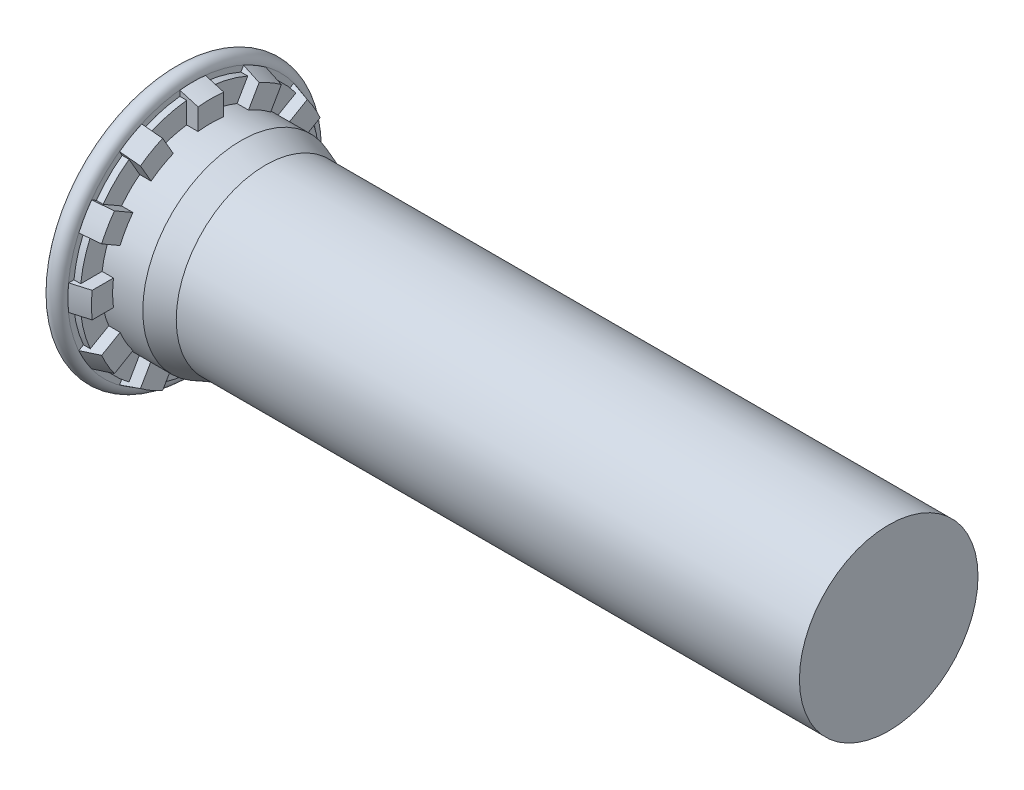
ISO-10303-21;
HEADER;
FILE_DESCRIPTION(('STEP AP214'),'2;1');
FILE_NAME('part.step','',(''),(''),'','','');
FILE_SCHEMA(('AUTOMOTIVE_DESIGN { 1 0 10303 214 1 1 1 1 }'));
ENDSEC;
DATA;
#1=APPLICATION_CONTEXT('core data for automotive mechanical design processes');
#2=APPLICATION_PROTOCOL_DEFINITION('international standard','automotive_design',2000,#1);
#3=PRODUCT_CONTEXT('',#1,'mechanical');
#4=PRODUCT('Part','Part','',(#3));
#5=PRODUCT_RELATED_PRODUCT_CATEGORY('part','',(#4));
#6=PRODUCT_DEFINITION_FORMATION('','',#4);
#7=PRODUCT_DEFINITION_CONTEXT('part definition',#1,'design');
#8=PRODUCT_DEFINITION('design','',#6,#7);
#9=PRODUCT_DEFINITION_SHAPE('','',#8);
#10=(LENGTH_UNIT() NAMED_UNIT(*) SI_UNIT(.MILLI.,.METRE.));
#11=(NAMED_UNIT(*) PLANE_ANGLE_UNIT() SI_UNIT($,.RADIAN.));
#12=(NAMED_UNIT(*) SI_UNIT($,.STERADIAN.) SOLID_ANGLE_UNIT());
#13=UNCERTAINTY_MEASURE_WITH_UNIT(LENGTH_MEASURE(1.E-05),#10,'distance_accuracy_value','');
#14=(GEOMETRIC_REPRESENTATION_CONTEXT(3) GLOBAL_UNCERTAINTY_ASSIGNED_CONTEXT((#13)) GLOBAL_UNIT_ASSIGNED_CONTEXT((#10,
#11,#12)) REPRESENTATION_CONTEXT('',''));
#15=CARTESIAN_POINT('',(0.,0.,0.));
#16=DIRECTION('',(0.,0.,1.));
#17=DIRECTION('',(1.,0.,0.));
#18=AXIS2_PLACEMENT_3D('',#15,#16,#17);
#19=CARTESIAN_POINT('',(0.51,0.,0.));
#20=DIRECTION('',(-1.,0.,0.));
#21=DIRECTION('',(0.,0.,1.));
#22=AXIS2_PLACEMENT_3D('',#19,#20,#21);
#23=CONICAL_SURFACE('',#22,3.4925,0.284019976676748);
#24=CARTESIAN_POINT('',(0.51,0.,0.));
#25=DIRECTION('',(-1.,0.,0.));
#26=DIRECTION('',(0.,0.,1.));
#27=AXIS2_PLACEMENT_3D('',#24,#25,#26);
#28=CIRCLE('',#27,3.4925);
#29=CARTESIAN_POINT('',(0.51,2.82910338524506,2.04785992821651));
#30=VERTEX_POINT('',#29);
#31=CARTESIAN_POINT('',(0.51,3.1880504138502,1.42614543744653));
#32=VERTEX_POINT('',#31);
#33=EDGE_CURVE('E966',#30,#32,#28,.T.);
#34=ORIENTED_EDGE('',*,*,#33,.F.);
#35=CARTESIAN_POINT('',(1.0202,2.69940579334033,1.97297898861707));
#36=CARTESIAN_POINT('',(0.913817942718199,2.72645564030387,1.98859622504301));
#37=CARTESIAN_POINT('',(0.807434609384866,2.75350172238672,2.00421128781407));
#38=CARTESIAN_POINT('',(0.637300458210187,2.79674878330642,2.02917999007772));
#39=CARTESIAN_POINT('',(0.573550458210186,2.81295217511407,2.03853502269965));
#40=CARTESIAN_POINT('',(0.509799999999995,2.82915421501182,2.04788927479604));
#41=B_SPLINE_CURVE_WITH_KNOTS('',3,(#35,#36,#37,#38,#39,#40),.UNSPECIFIED.,.F.,.F.,(4,2,4),(0.,
0.332617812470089,0.531934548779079),.UNSPECIFIED.);
#42=CARTESIAN_POINT('',(1.02,2.69945664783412,1.97300834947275));
#43=VERTEX_POINT('',#42);
#44=EDGE_CURVE('E967',#43,#30,#41,.T.);
#45=ORIENTED_EDGE('',*,*,#44,.F.);
#46=CARTESIAN_POINT('',(1.02,0.,0.));
#47=DIRECTION('',(-1.,0.,0.));
#48=DIRECTION('',(0.,0.,1.));
#49=AXIS2_PLACEMENT_3D('',#46,#47,#48);
#50=CIRCLE('',#49,3.343625);
#51=CARTESIAN_POINT('',(1.02,3.05840367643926,1.35129385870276));
#52=VERTEX_POINT('',#51);
#53=EDGE_CURVE('E1235',#43,#52,#50,.T.);
#54=ORIENTED_EDGE('',*,*,#53,.T.);
#55=CARTESIAN_POINT('',(0.509799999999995,3.18810124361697,1.42617478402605));
#56=CARTESIAN_POINT('',(0.573550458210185,3.17189920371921,1.41682053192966));
#57=CARTESIAN_POINT('',(0.637300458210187,3.15569581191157,1.40746549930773));
#58=CARTESIAN_POINT('',(0.807434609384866,3.11244875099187,1.38249679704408));
#59=CARTESIAN_POINT('',(0.913817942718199,3.08540266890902,1.36688173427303));
#60=CARTESIAN_POINT('',(1.0202,3.05835282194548,1.35126449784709));
#61=B_SPLINE_CURVE_WITH_KNOTS('',3,(#55,#56,#57,#58,#59,#60),.UNSPECIFIED.,.F.,.F.,(4,2,4),(0.,
0.19931673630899,0.531934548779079),.UNSPECIFIED.);
#62=EDGE_CURVE('E855',#32,#52,#61,.T.);
#63=ORIENTED_EDGE('',*,*,#62,.F.);
#64=EDGE_LOOP('',(#34,#45,#54,#63));
#65=FACE_BOUND('',#64,.T.);
#66=ADVANCED_FACE('F39',(#65),#23,.T.);
#67=CARTESIAN_POINT('',(0.509799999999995,2.04788927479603,2.82915421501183));
#68=CARTESIAN_POINT('',(0.573550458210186,2.03853502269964,2.81295217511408));
#69=CARTESIAN_POINT('',(0.637300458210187,2.02917999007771,2.79674878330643));
#70=CARTESIAN_POINT('',(0.807434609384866,2.00421128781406,2.75350172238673));
#71=CARTESIAN_POINT('',(0.913817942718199,1.988596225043,2.72645564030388));
#72=CARTESIAN_POINT('',(1.0202,1.97297898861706,2.69940579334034));
#73=B_SPLINE_CURVE_WITH_KNOTS('',3,(#67,#68,#69,#70,#71,#72),.UNSPECIFIED.,.F.,.F.,(4,2,4),(0.,
0.19931673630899,0.531934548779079),.UNSPECIFIED.);
#74=CARTESIAN_POINT('',(0.51,2.0478599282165,2.82910338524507));
#75=VERTEX_POINT('',#74);
#76=CARTESIAN_POINT('',(1.02,1.97300834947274,2.69945664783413));
#77=VERTEX_POINT('',#76);
#78=EDGE_CURVE('E1274',#75,#77,#73,.T.);
#79=ORIENTED_EDGE('',*,*,#78,.F.);
#80=CARTESIAN_POINT('',(0.51,1.42614543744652,3.18805041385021));
#81=VERTEX_POINT('',#80);
#82=EDGE_CURVE('E501',#81,#75,#28,.T.);
#83=ORIENTED_EDGE('',*,*,#82,.F.);
#84=CARTESIAN_POINT('',(1.0202,1.35126449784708,3.05835282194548));
#85=CARTESIAN_POINT('',(0.913817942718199,1.36688173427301,3.08540266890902));
#86=CARTESIAN_POINT('',(0.807434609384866,1.38249679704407,3.11244875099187));
#87=CARTESIAN_POINT('',(0.637300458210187,1.40746549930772,3.15569581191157));
#88=CARTESIAN_POINT('',(0.573550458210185,1.41682053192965,3.17189920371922));
#89=CARTESIAN_POINT('',(0.509799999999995,1.42617478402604,3.18810124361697));
#90=B_SPLINE_CURVE_WITH_KNOTS('',3,(#84,#85,#86,#87,#88,#89),.UNSPECIFIED.,.F.,.F.,(4,2,4),(0.,
0.332617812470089,0.531934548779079),.UNSPECIFIED.);
#91=CARTESIAN_POINT('',(1.02,1.35129385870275,3.05840367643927));
#92=VERTEX_POINT('',#91);
#93=EDGE_CURVE('E1016',#92,#81,#90,.T.);
#94=ORIENTED_EDGE('',*,*,#93,.F.);
#95=EDGE_CURVE('E1240',#92,#77,#50,.T.);
#96=ORIENTED_EDGE('',*,*,#95,.T.);
#97=EDGE_LOOP('',(#79,#83,#94,#96));
#98=FACE_BOUND('',#97,.T.);
#99=ADVANCED_FACE('F955',(#98),#23,.T.);
#100=CARTESIAN_POINT('',(-0.816462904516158,0.358947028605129,3.86306972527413));
#101=CARTESIAN_POINT('',(-0.284167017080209,0.35894702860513,3.70704643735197));
#102=CARTESIAN_POINT('',(0.248096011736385,0.35894702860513,3.55091122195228));
#103=CARTESIAN_POINT('',(1.31255635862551,0.358947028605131,3.23841693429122));
#104=CARTESIAN_POINT('',(1.84475367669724,0.358947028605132,3.08205786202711));
#105=CARTESIAN_POINT('',(2.37691813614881,0.358947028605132,2.92558686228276));
#106=B_SPLINE_CURVE_WITH_KNOTS('',3,(#100,#101,#102,#103,#104,#105),.UNSPECIFIED.,.F.,.F.,(4,2,
4),(0.,1.66407308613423,3.32814619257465),.UNSPECIFIED.);
#107=CARTESIAN_POINT('',(0.51,0.358947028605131,3.47400536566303));
#108=VERTEX_POINT('',#107);
#109=CARTESIAN_POINT('',(1.02,0.358947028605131,3.32430220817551));
#110=VERTEX_POINT('',#109);
#111=EDGE_CURVE('E1012',#108,#110,#106,.T.);
#112=ORIENTED_EDGE('',*,*,#111,.F.);
#113=CARTESIAN_POINT('',(0.51,-0.358947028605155,3.47400536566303));
#114=VERTEX_POINT('',#113);
#115=EDGE_CURVE('E973',#114,#108,#28,.T.);
#116=ORIENTED_EDGE('',*,*,#115,.F.);
#117=CARTESIAN_POINT('',(2.37691813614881,-0.358947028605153,2.92558686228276));
#118=CARTESIAN_POINT('',(1.84475367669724,-0.358947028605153,3.08205786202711));
#119=CARTESIAN_POINT('',(1.31255635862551,-0.358947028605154,3.23841693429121));
#120=CARTESIAN_POINT('',(0.248096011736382,-0.358947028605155,3.55091122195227));
#121=CARTESIAN_POINT('',(-0.284167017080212,-0.358947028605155,3.70704643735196));
#122=CARTESIAN_POINT('',(-0.816462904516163,-0.358947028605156,3.86306972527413));
#123=B_SPLINE_CURVE_WITH_KNOTS('',3,(#117,#118,#119,#120,#121,#122),.UNSPECIFIED.,.F.,.F.,(4,2,
4),(0.,1.66407310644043,3.32814619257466),.UNSPECIFIED.);
#124=CARTESIAN_POINT('',(1.02,-0.358947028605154,3.32430220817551));
#125=VERTEX_POINT('',#124);
#126=EDGE_CURVE('E1010',#125,#114,#123,.T.);
#127=ORIENTED_EDGE('',*,*,#126,.F.);
#128=EDGE_CURVE('E1013',#125,#110,#50,.T.);
#129=ORIENTED_EDGE('',*,*,#128,.T.);
#130=EDGE_LOOP('',(#112,#116,#127,#129));
#131=FACE_BOUND('',#130,.T.);
#132=ADVANCED_FACE('F961',(#131),#23,.T.);
#133=CARTESIAN_POINT('',(0.5098,-1.42617478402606,3.18810124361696));
#134=CARTESIAN_POINT('',(0.573550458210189,-1.41682053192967,3.17189920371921));
#135=CARTESIAN_POINT('',(0.637300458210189,-1.40746549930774,3.15569581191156));
#136=CARTESIAN_POINT('',(0.807434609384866,-1.38249679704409,3.11244875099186));
#137=CARTESIAN_POINT('',(0.913817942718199,-1.36688173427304,3.08540266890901));
#138=CARTESIAN_POINT('',(1.0202,-1.3512644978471,3.05835282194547));
#139=B_SPLINE_CURVE_WITH_KNOTS('',3,(#133,#134,#135,#136,#137,#138),.UNSPECIFIED.,.F.,.F.,(4,2,
4),(0.,0.199316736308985,0.531934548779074),.UNSPECIFIED.);
#140=CARTESIAN_POINT('',(0.51,-1.42614543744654,3.1880504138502));
#141=VERTEX_POINT('',#140);
#142=CARTESIAN_POINT('',(1.02,-1.35129385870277,3.05840367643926));
#143=VERTEX_POINT('',#142);
#144=EDGE_CURVE('E1032',#141,#143,#139,.T.);
#145=ORIENTED_EDGE('',*,*,#144,.F.);
#146=CARTESIAN_POINT('',(0.51,-2.04785992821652,2.82910338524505));
#147=VERTEX_POINT('',#146);
#148=EDGE_CURVE('E998',#147,#141,#28,.T.);
#149=ORIENTED_EDGE('',*,*,#148,.F.);
#150=CARTESIAN_POINT('',(1.0202,-1.97297898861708,2.69940579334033));
#151=CARTESIAN_POINT('',(0.913817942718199,-1.98859622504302,2.72645564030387));
#152=CARTESIAN_POINT('',(0.807434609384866,-2.00421128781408,2.75350172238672));
#153=CARTESIAN_POINT('',(0.637300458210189,-2.02917999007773,2.79674878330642));
#154=CARTESIAN_POINT('',(0.573550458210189,-2.03853502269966,2.81295217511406));
#155=CARTESIAN_POINT('',(0.5098,-2.04788927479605,2.82915421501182));
#156=B_SPLINE_CURVE_WITH_KNOTS('',3,(#150,#151,#152,#153,#154,#155),.UNSPECIFIED.,.F.,.F.,(4,2,
4),(0.,0.332617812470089,0.531934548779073),.UNSPECIFIED.);
#157=CARTESIAN_POINT('',(1.02,-1.97300834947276,2.69945664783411));
#158=VERTEX_POINT('',#157);
#159=EDGE_CURVE('E1084',#158,#147,#156,.T.);
#160=ORIENTED_EDGE('',*,*,#159,.F.);
#161=EDGE_CURVE('E1346',#158,#143,#50,.T.);
#162=ORIENTED_EDGE('',*,*,#161,.T.);
#163=EDGE_LOOP('',(#145,#149,#160,#162));
#164=FACE_BOUND('',#163,.T.);
#165=ADVANCED_FACE('F1481',(#164),#23,.T.);
#166=CARTESIAN_POINT('',(0.5098,-2.82915421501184,2.04788927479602));
#167=CARTESIAN_POINT('',(0.573550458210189,-2.81295217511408,2.03853502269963));
#168=CARTESIAN_POINT('',(0.637300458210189,-2.79674878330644,2.0291799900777));
#169=CARTESIAN_POINT('',(0.807434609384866,-2.75350172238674,2.00421128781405));
#170=CARTESIAN_POINT('',(0.913817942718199,-2.72645564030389,1.98859622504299));
#171=CARTESIAN_POINT('',(1.0202,-2.69940579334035,1.97297898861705));
#172=B_SPLINE_CURVE_WITH_KNOTS('',3,(#166,#167,#168,#169,#170,#171),.UNSPECIFIED.,.F.,.F.,(4,2,
4),(0.,0.199316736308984,0.531934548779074),.UNSPECIFIED.);
#173=CARTESIAN_POINT('',(0.51,-2.82910338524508,2.04785992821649));
#174=VERTEX_POINT('',#173);
#175=CARTESIAN_POINT('',(1.02,-2.69945664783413,1.97300834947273));
#176=VERTEX_POINT('',#175);
#177=EDGE_CURVE('E1078',#174,#176,#172,.T.);
#178=ORIENTED_EDGE('',*,*,#177,.F.);
#179=CARTESIAN_POINT('',(0.51,-3.18805041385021,1.4261454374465));
#180=VERTEX_POINT('',#179);
#181=EDGE_CURVE('E995',#180,#174,#28,.T.);
#182=ORIENTED_EDGE('',*,*,#181,.F.);
#183=CARTESIAN_POINT('',(1.0202,-3.05835282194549,1.35126449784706));
#184=CARTESIAN_POINT('',(0.913817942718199,-3.08540266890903,1.366881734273));
#185=CARTESIAN_POINT('',(0.807434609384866,-3.11244875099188,1.38249679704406));
#186=CARTESIAN_POINT('',(0.637300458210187,-3.15569581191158,1.40746549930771));
#187=CARTESIAN_POINT('',(0.573550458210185,-3.17189920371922,1.41682053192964));
#188=CARTESIAN_POINT('',(0.509799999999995,-3.18810124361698,1.42617478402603));
#189=B_SPLINE_CURVE_WITH_KNOTS('',3,(#183,#184,#185,#186,#187,#188),.UNSPECIFIED.,.F.,.F.,(4,2,
4),(0.,0.332617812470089,0.531934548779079),.UNSPECIFIED.);
#190=CARTESIAN_POINT('',(1.02,-3.05840367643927,1.35129385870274));
#191=VERTEX_POINT('',#190);
#192=EDGE_CURVE('E1119',#191,#180,#189,.T.);
#193=ORIENTED_EDGE('',*,*,#192,.F.);
#194=EDGE_CURVE('E1341',#191,#176,#50,.T.);
#195=ORIENTED_EDGE('',*,*,#194,.T.);
#196=EDGE_LOOP('',(#178,#182,#193,#195));
#197=FACE_BOUND('',#196,.T.);
#198=ADVANCED_FACE('F1452',(#197),#23,.T.);
#199=CARTESIAN_POINT('',(-0.816462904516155,-3.86306972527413,0.358947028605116));
#200=CARTESIAN_POINT('',(-0.284167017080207,-3.70704643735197,0.358947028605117));
#201=CARTESIAN_POINT('',(0.248096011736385,-3.55091122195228,0.358947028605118));
#202=CARTESIAN_POINT('',(1.31255635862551,-3.23841693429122,0.35894702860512));
#203=CARTESIAN_POINT('',(1.84475367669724,-3.08205786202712,0.358947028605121));
#204=CARTESIAN_POINT('',(2.37691813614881,-2.92558686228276,0.358947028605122));
#205=B_SPLINE_CURVE_WITH_KNOTS('',3,(#199,#200,#201,#202,#203,#204),.UNSPECIFIED.,.F.,.F.,(4,2,
4),(0.,1.66407308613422,3.32814619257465),.UNSPECIFIED.);
#206=CARTESIAN_POINT('',(0.51,-3.47400536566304,0.358947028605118));
#207=VERTEX_POINT('',#206);
#208=CARTESIAN_POINT('',(1.02,-3.32430220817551,0.358947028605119));
#209=VERTEX_POINT('',#208);
#210=EDGE_CURVE('E1113',#207,#209,#205,.T.);
#211=ORIENTED_EDGE('',*,*,#210,.F.);
#212=CARTESIAN_POINT('',(0.51,-3.47400536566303,-0.358947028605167));
#213=VERTEX_POINT('',#212);
#214=EDGE_CURVE('E992',#213,#207,#28,.T.);
#215=ORIENTED_EDGE('',*,*,#214,.F.);
#216=CARTESIAN_POINT('',(2.37691813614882,-2.92558686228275,-0.358947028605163));
#217=CARTESIAN_POINT('',(1.84475367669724,-3.08205786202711,-0.358947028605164));
#218=CARTESIAN_POINT('',(1.31255635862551,-3.23841693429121,-0.358947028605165));
#219=CARTESIAN_POINT('',(0.248096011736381,-3.55091122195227,-0.358947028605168));
#220=CARTESIAN_POINT('',(-0.284167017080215,-3.70704643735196,-0.358947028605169));
#221=CARTESIAN_POINT('',(-0.816462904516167,-3.86306972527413,-0.35894702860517));
#222=B_SPLINE_CURVE_WITH_KNOTS('',3,(#216,#217,#218,#219,#220,#221),.UNSPECIFIED.,.F.,.F.,(4,2,
4),(0.,1.66407310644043,3.32814619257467),.UNSPECIFIED.);
#223=CARTESIAN_POINT('',(1.02,-3.3243022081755,-0.358947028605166));
#224=VERTEX_POINT('',#223);
#225=EDGE_CURVE('E1132',#224,#213,#222,.T.);
#226=ORIENTED_EDGE('',*,*,#225,.F.);
#227=EDGE_CURVE('E1336',#224,#209,#50,.T.);
#228=ORIENTED_EDGE('',*,*,#227,.T.);
#229=EDGE_LOOP('',(#211,#215,#226,#228));
#230=FACE_BOUND('',#229,.T.);
#231=ADVANCED_FACE('F1448',(#230),#23,.T.);
#232=CARTESIAN_POINT('',(0.5098,-3.18810124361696,-1.42617478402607));
#233=CARTESIAN_POINT('',(0.573550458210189,-3.1718992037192,-1.41682053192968));
#234=CARTESIAN_POINT('',(0.637300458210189,-3.15569581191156,-1.40746549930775));
#235=CARTESIAN_POINT('',(0.807434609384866,-3.11244875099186,-1.3824967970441));
#236=CARTESIAN_POINT('',(0.913817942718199,-3.08540266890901,-1.36688173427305));
#237=CARTESIAN_POINT('',(1.0202,-3.05835282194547,-1.35126449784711));
#238=B_SPLINE_CURVE_WITH_KNOTS('',3,(#232,#233,#234,#235,#236,#237),.UNSPECIFIED.,.F.,.F.,(4,2,
4),(0.,0.199316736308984,0.531934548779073),.UNSPECIFIED.);
#239=CARTESIAN_POINT('',(0.51,-3.18805041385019,-1.42614543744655));
#240=VERTEX_POINT('',#239);
#241=CARTESIAN_POINT('',(1.02,-3.05840367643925,-1.35129385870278));
#242=VERTEX_POINT('',#241);
#243=EDGE_CURVE('E1125',#240,#242,#238,.T.);
#244=ORIENTED_EDGE('',*,*,#243,.F.);
#245=CARTESIAN_POINT('',(0.51,-2.82910338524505,-2.04785992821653));
#246=VERTEX_POINT('',#245);
#247=EDGE_CURVE('E989',#246,#240,#28,.T.);
#248=ORIENTED_EDGE('',*,*,#247,.F.);
#249=CARTESIAN_POINT('',(1.0202,-2.69940579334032,-1.97297898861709));
#250=CARTESIAN_POINT('',(0.913817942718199,-2.72645564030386,-1.98859622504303));
#251=CARTESIAN_POINT('',(0.807434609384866,-2.75350172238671,-2.00421128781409));
#252=CARTESIAN_POINT('',(0.637300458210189,-2.79674878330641,-2.02917999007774));
#253=CARTESIAN_POINT('',(0.573550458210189,-2.81295217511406,-2.03853502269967));
#254=CARTESIAN_POINT('',(0.5098,-2.82915421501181,-2.04788927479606));
#255=B_SPLINE_CURVE_WITH_KNOTS('',3,(#249,#250,#251,#252,#253,#254),.UNSPECIFIED.,.F.,.F.,(4,2,
4),(0.,0.332617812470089,0.531934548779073),.UNSPECIFIED.);
#256=CARTESIAN_POINT('',(1.02,-2.69945664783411,-1.97300834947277));
#257=VERTEX_POINT('',#256);
#258=EDGE_CURVE('E1167',#257,#246,#255,.T.);
#259=ORIENTED_EDGE('',*,*,#258,.F.);
#260=EDGE_CURVE('E1331',#257,#242,#50,.T.);
#261=ORIENTED_EDGE('',*,*,#260,.T.);
#262=EDGE_LOOP('',(#244,#248,#259,#261));
#263=FACE_BOUND('',#262,.T.);
#264=ADVANCED_FACE('F1444',(#263),#23,.T.);
#265=CARTESIAN_POINT('',(0.5098,-2.04788927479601,-2.82915421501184));
#266=CARTESIAN_POINT('',(0.573550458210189,-2.03853502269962,-2.81295217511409));
#267=CARTESIAN_POINT('',(0.637300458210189,-2.02917999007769,-2.79674878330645));
#268=CARTESIAN_POINT('',(0.807434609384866,-2.00421128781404,-2.75350172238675));
#269=CARTESIAN_POINT('',(0.913817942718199,-1.98859622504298,-2.72645564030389));
#270=CARTESIAN_POINT('',(1.0202,-1.97297898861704,-2.69940579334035));
#271=B_SPLINE_CURVE_WITH_KNOTS('',3,(#265,#266,#267,#268,#269,#270),.UNSPECIFIED.,.F.,.F.,(4,2,
4),(0.,0.199316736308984,0.531934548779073),.UNSPECIFIED.);
#272=CARTESIAN_POINT('',(0.51,-2.04785992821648,-2.82910338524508));
#273=VERTEX_POINT('',#272);
#274=CARTESIAN_POINT('',(1.02,-1.97300834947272,-2.69945664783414));
#275=VERTEX_POINT('',#274);
#276=EDGE_CURVE('E1161',#273,#275,#271,.T.);
#277=ORIENTED_EDGE('',*,*,#276,.F.);
#278=CARTESIAN_POINT('',(0.51,-1.42614543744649,-3.18805041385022));
#279=VERTEX_POINT('',#278);
#280=EDGE_CURVE('E986',#279,#273,#28,.T.);
#281=ORIENTED_EDGE('',*,*,#280,.F.);
#282=CARTESIAN_POINT('',(1.0202,-1.35126449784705,-3.05835282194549));
#283=CARTESIAN_POINT('',(0.913817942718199,-1.36688173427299,-3.08540266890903));
#284=CARTESIAN_POINT('',(0.807434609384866,-1.38249679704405,-3.11244875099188));
#285=CARTESIAN_POINT('',(0.637300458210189,-1.4074654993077,-3.15569581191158));
#286=CARTESIAN_POINT('',(0.573550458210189,-1.41682053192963,-3.17189920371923));
#287=CARTESIAN_POINT('',(0.5098,-1.42617478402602,-3.18810124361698));
#288=B_SPLINE_CURVE_WITH_KNOTS('',3,(#282,#283,#284,#285,#286,#287),.UNSPECIFIED.,.F.,.F.,(4,2,
4),(0.,0.332617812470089,0.531934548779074),.UNSPECIFIED.);
#289=CARTESIAN_POINT('',(1.02,-1.35129385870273,-3.05840367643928));
#290=VERTEX_POINT('',#289);
#291=EDGE_CURVE('E1180',#290,#279,#288,.T.);
#292=ORIENTED_EDGE('',*,*,#291,.F.);
#293=EDGE_CURVE('E1329',#290,#275,#50,.T.);
#294=ORIENTED_EDGE('',*,*,#293,.T.);
#295=EDGE_LOOP('',(#277,#281,#292,#294));
#296=FACE_BOUND('',#295,.T.);
#297=ADVANCED_FACE('F1425',(#296),#23,.T.);
#298=CARTESIAN_POINT('',(-0.816462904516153,-0.358947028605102,-3.86306972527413));
#299=CARTESIAN_POINT('',(-0.284167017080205,-0.358947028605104,-3.70704643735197));
#300=CARTESIAN_POINT('',(0.248096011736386,-0.358947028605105,-3.55091122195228));
#301=CARTESIAN_POINT('',(1.31255635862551,-0.358947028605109,-3.23841693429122));
#302=CARTESIAN_POINT('',(1.84475367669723,-0.35894702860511,-3.08205786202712));
#303=CARTESIAN_POINT('',(2.3769181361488,-0.358947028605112,-2.92558686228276));
#304=B_SPLINE_CURVE_WITH_KNOTS('',3,(#298,#299,#300,#301,#302,#303),.UNSPECIFIED.,.F.,.F.,(4,2,
4),(0.,1.66407308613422,3.32814619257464),.UNSPECIFIED.);
#305=CARTESIAN_POINT('',(0.51,-0.358947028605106,-3.47400536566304));
#306=VERTEX_POINT('',#305);
#307=CARTESIAN_POINT('',(1.02,-0.358947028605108,-3.32430220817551));
#308=VERTEX_POINT('',#307);
#309=EDGE_CURVE('E1173',#306,#308,#304,.T.);
#310=ORIENTED_EDGE('',*,*,#309,.F.);
#311=CARTESIAN_POINT('',(0.51,0.358947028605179,-3.47400536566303));
#312=VERTEX_POINT('',#311);
#313=EDGE_CURVE('E983',#312,#306,#28,.T.);
#314=ORIENTED_EDGE('',*,*,#313,.F.);
#315=CARTESIAN_POINT('',(2.37691813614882,0.358947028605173,-2.92558686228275));
#316=CARTESIAN_POINT('',(1.84475367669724,0.358947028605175,-3.08205786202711));
#317=CARTESIAN_POINT('',(1.31255635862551,0.358947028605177,-3.23841693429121));
#318=CARTESIAN_POINT('',(0.24809601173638,0.35894702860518,-3.55091122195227));
#319=CARTESIAN_POINT('',(-0.284167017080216,0.358947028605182,-3.70704643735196));
#320=CARTESIAN_POINT('',(-0.816462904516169,0.358947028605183,-3.86306972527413));
#321=B_SPLINE_CURVE_WITH_KNOTS('',3,(#315,#316,#317,#318,#319,#320),.UNSPECIFIED.,.F.,.F.,(4,2,
4),(0.,1.66407310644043,3.32814619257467),.UNSPECIFIED.);
#322=CARTESIAN_POINT('',(1.02,0.358947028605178,-3.3243022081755));
#323=VERTEX_POINT('',#322);
#324=EDGE_CURVE('E1212',#323,#312,#321,.T.);
#325=ORIENTED_EDGE('',*,*,#324,.F.);
#326=EDGE_CURVE('E1238',#323,#308,#50,.T.);
#327=ORIENTED_EDGE('',*,*,#326,.T.);
#328=EDGE_LOOP('',(#310,#314,#325,#327));
#329=FACE_BOUND('',#328,.T.);
#330=ADVANCED_FACE('F1436',(#329),#23,.T.);
#331=CARTESIAN_POINT('',(0.509799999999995,1.42617478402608,-3.18810124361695));
#332=CARTESIAN_POINT('',(0.573550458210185,1.4168205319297,-3.1718992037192));
#333=CARTESIAN_POINT('',(0.637300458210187,1.40746549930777,-3.15569581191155));
#334=CARTESIAN_POINT('',(0.807434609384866,1.38249679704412,-3.11244875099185));
#335=CARTESIAN_POINT('',(0.913817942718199,1.36688173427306,-3.085402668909));
#336=CARTESIAN_POINT('',(1.0202,1.35126449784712,-3.05835282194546));
#337=B_SPLINE_CURVE_WITH_KNOTS('',3,(#331,#332,#333,#334,#335,#336),.UNSPECIFIED.,.F.,.F.,(4,2,
4),(0.,0.19931673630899,0.531934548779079),.UNSPECIFIED.);
#338=CARTESIAN_POINT('',(0.51,1.42614543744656,-3.18805041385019));
#339=VERTEX_POINT('',#338);
#340=CARTESIAN_POINT('',(1.02,1.3512938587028,-3.05840367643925));
#341=VERTEX_POINT('',#340);
#342=EDGE_CURVE('E1207',#339,#341,#337,.T.);
#343=ORIENTED_EDGE('',*,*,#342,.F.);
#344=CARTESIAN_POINT('',(0.51,2.04785992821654,-2.82910338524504));
#345=VERTEX_POINT('',#344);
#346=EDGE_CURVE('E975',#345,#339,#28,.T.);
#347=ORIENTED_EDGE('',*,*,#346,.F.);
#348=CARTESIAN_POINT('',(1.0202,1.9729789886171,-2.69940579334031));
#349=CARTESIAN_POINT('',(0.913817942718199,1.98859622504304,-2.72645564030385));
#350=CARTESIAN_POINT('',(0.807434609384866,2.0042112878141,-2.7535017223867));
#351=CARTESIAN_POINT('',(0.637300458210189,2.02917999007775,-2.7967487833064));
#352=CARTESIAN_POINT('',(0.573550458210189,2.03853502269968,-2.81295217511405));
#353=CARTESIAN_POINT('',(0.5098,2.04788927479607,-2.8291542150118));
#354=B_SPLINE_CURVE_WITH_KNOTS('',3,(#348,#349,#350,#351,#352,#353),.UNSPECIFIED.,.F.,.F.,(4,2,
4),(0.,0.332617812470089,0.531934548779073),.UNSPECIFIED.);
#355=CARTESIAN_POINT('',(1.02,1.97300834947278,-2.6994566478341));
#356=VERTEX_POINT('',#355);
#357=EDGE_CURVE('E662',#356,#345,#354,.T.);
#358=ORIENTED_EDGE('',*,*,#357,.F.);
#359=EDGE_CURVE('E1234',#356,#341,#50,.T.);
#360=ORIENTED_EDGE('',*,*,#359,.T.);
#361=EDGE_LOOP('',(#343,#347,#358,#360));
#362=FACE_BOUND('',#361,.T.);
#363=ADVANCED_FACE('F1438',(#362),#23,.T.);
#364=CARTESIAN_POINT('',(0.51,3.47400536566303,0.358947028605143));
#365=VERTEX_POINT('',#364);
#366=CARTESIAN_POINT('',(0.51,3.47400536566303,-0.358947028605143));
#367=VERTEX_POINT('',#366);
#368=EDGE_CURVE('E970',#365,#367,#28,.T.);
#369=ORIENTED_EDGE('',*,*,#368,.F.);
#370=CARTESIAN_POINT('',(2.37691813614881,2.92558686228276,0.358947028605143));
#371=CARTESIAN_POINT('',(1.84475367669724,3.08205786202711,0.358947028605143));
#372=CARTESIAN_POINT('',(1.31255635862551,3.23841693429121,0.358947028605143));
#373=CARTESIAN_POINT('',(0.248096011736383,3.55091122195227,0.358947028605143));
#374=CARTESIAN_POINT('',(-0.284167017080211,3.70704643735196,0.358947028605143));
#375=CARTESIAN_POINT('',(-0.816462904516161,3.86306972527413,0.358947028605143));
#376=B_SPLINE_CURVE_WITH_KNOTS('',3,(#370,#371,#372,#373,#374,#375),.UNSPECIFIED.,.F.,.F.,(4,2,
4),(0.,1.66407310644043,3.32814619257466),.UNSPECIFIED.);
#377=CARTESIAN_POINT('',(1.02,3.32430220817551,0.358947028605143));
#378=VERTEX_POINT('',#377);
#379=EDGE_CURVE('E864',#378,#365,#376,.T.);
#380=ORIENTED_EDGE('',*,*,#379,.F.);
#381=CARTESIAN_POINT('',(1.02,3.32430220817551,-0.358947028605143));
#382=VERTEX_POINT('',#381);
#383=EDGE_CURVE('E1236',#378,#382,#50,.T.);
#384=ORIENTED_EDGE('',*,*,#383,.T.);
#385=CARTESIAN_POINT('',(-0.816462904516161,3.86306972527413,-0.358947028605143));
#386=CARTESIAN_POINT('',(-0.284167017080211,3.70704643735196,-0.358947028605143));
#387=CARTESIAN_POINT('',(0.248096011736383,3.55091122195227,-0.358947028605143));
#388=CARTESIAN_POINT('',(1.31255635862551,3.23841693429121,-0.358947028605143));
#389=CARTESIAN_POINT('',(1.84475367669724,3.08205786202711,-0.358947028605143));
#390=CARTESIAN_POINT('',(2.37691813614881,2.92558686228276,-0.358947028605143));
#391=B_SPLINE_CURVE_WITH_KNOTS('',3,(#385,#386,#387,#388,#389,#390),.UNSPECIFIED.,.F.,.F.,(4,2,
4),(0.,1.66407308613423,3.32814619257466),.UNSPECIFIED.);
#392=EDGE_CURVE('E907',#367,#382,#391,.T.);
#393=ORIENTED_EDGE('',*,*,#392,.F.);
#394=EDGE_LOOP('',(#369,#380,#384,#393));
#395=FACE_BOUND('',#394,.T.);
#396=ADVANCED_FACE('F946',(#395),#23,.T.);
#397=CARTESIAN_POINT('',(1.02,3.343625,0.));
#398=DIRECTION('',(1.,0.,0.));
#399=DIRECTION('',(0.,0.,-1.));
#400=AXIS2_PLACEMENT_3D('',#397,#398,#399);
#401=PLANE('',#400);
#402=DIRECTION('',(0.,-0.499999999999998,-0.86602540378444));
#403=VECTOR('',#402,1.);
#404=CARTESIAN_POINT('',(1.02,1.67409392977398,2.1817216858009));
#405=LINE('',#404,#403);
#406=CARTESIAN_POINT('',(1.02,1.67409392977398,2.1817216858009));
#407=VERTEX_POINT('',#406);
#408=EDGE_CURVE('E653',#77,#407,#405,.T.);
#409=ORIENTED_EDGE('',*,*,#408,.F.);
#410=ORIENTED_EDGE('',*,*,#95,.F.);
#411=DIRECTION('',(0.,0.499999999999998,0.86602540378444));
#412=VECTOR('',#411,1.);
#413=CARTESIAN_POINT('',(1.02,1.05237943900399,2.54066871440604));
#414=LINE('',#413,#412);
#415=CARTESIAN_POINT('',(1.02,1.05237943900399,2.54066871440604));
#416=VERTEX_POINT('',#415);
#417=EDGE_CURVE('E674',#416,#92,#414,.T.);
#418=ORIENTED_EDGE('',*,*,#417,.F.);
#419=CARTESIAN_POINT('',(1.02,0.,0.));
#420=DIRECTION('',(-1.,0.,0.));
#421=DIRECTION('',(0.,0.,1.));
#422=AXIS2_PLACEMENT_3D('',#419,#420,#421);
#423=CIRCLE('',#422,2.75);
#424=EDGE_CURVE('E1252',#416,#407,#423,.T.);
#425=ORIENTED_EDGE('',*,*,#424,.T.);
#426=EDGE_LOOP('',(#409,#410,#418,#425));
#427=FACE_BOUND('',#426,.T.);
#428=ADVANCED_FACE('F940',(#427),#401,.T.);
#429=DIRECTION('',(0.,0.,-1.));
#430=VECTOR('',#429,1.);
#431=CARTESIAN_POINT('',(1.02,0.358947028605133,2.72647336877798));
#432=LINE('',#431,#430);
#433=CARTESIAN_POINT('',(1.02,0.358947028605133,2.72647336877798));
#434=VERTEX_POINT('',#433);
#435=EDGE_CURVE('E668',#110,#434,#432,.T.);
#436=ORIENTED_EDGE('',*,*,#435,.F.);
#437=ORIENTED_EDGE('',*,*,#128,.F.);
#438=DIRECTION('',(0.,0.,1.));
#439=VECTOR('',#438,1.);
#440=CARTESIAN_POINT('',(1.02,-0.358947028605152,2.72647336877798));
#441=LINE('',#440,#439);
#442=CARTESIAN_POINT('',(1.02,-0.358947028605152,2.72647336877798));
#443=VERTEX_POINT('',#442);
#444=EDGE_CURVE('E690',#443,#125,#441,.T.);
#445=ORIENTED_EDGE('',*,*,#444,.F.);
#446=EDGE_CURVE('E1383',#443,#434,#423,.T.);
#447=ORIENTED_EDGE('',*,*,#446,.T.);
#448=EDGE_LOOP('',(#436,#437,#445,#447));
#449=FACE_BOUND('',#448,.T.);
#450=ADVANCED_FACE('F949',(#449),#401,.T.);
#451=DIRECTION('',(0.,0.500000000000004,-0.866025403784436));
#452=VECTOR('',#451,1.);
#453=CARTESIAN_POINT('',(1.02,-1.05237943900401,2.54066871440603));
#454=LINE('',#453,#452);
#455=CARTESIAN_POINT('',(1.02,-1.05237943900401,2.54066871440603));
#456=VERTEX_POINT('',#455);
#457=EDGE_CURVE('E684',#143,#456,#454,.T.);
#458=ORIENTED_EDGE('',*,*,#457,.F.);
#459=ORIENTED_EDGE('',*,*,#161,.F.);
#460=DIRECTION('',(0.,-0.500000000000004,0.866025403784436));
#461=VECTOR('',#460,1.);
#462=CARTESIAN_POINT('',(1.02,-1.67409392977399,2.18172168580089));
#463=LINE('',#462,#461);
#464=CARTESIAN_POINT('',(1.02,-1.67409392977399,2.18172168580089));
#465=VERTEX_POINT('',#464);
#466=EDGE_CURVE('E707',#465,#158,#463,.T.);
#467=ORIENTED_EDGE('',*,*,#466,.F.);
#468=EDGE_CURVE('E1385',#465,#456,#423,.T.);
#469=ORIENTED_EDGE('',*,*,#468,.T.);
#470=EDGE_LOOP('',(#458,#459,#467,#469));
#471=FACE_BOUND('',#470,.T.);
#472=ADVANCED_FACE('F1482',(#471),#401,.T.);
#473=DIRECTION('',(0.,0.866025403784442,-0.499999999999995));
#474=VECTOR('',#473,1.);
#475=CARTESIAN_POINT('',(1.02,-2.18172168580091,1.67409392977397));
#476=LINE('',#475,#474);
#477=CARTESIAN_POINT('',(1.02,-2.1817216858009,1.67409392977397));
#478=VERTEX_POINT('',#477);
#479=EDGE_CURVE('E701',#176,#478,#476,.T.);
#480=ORIENTED_EDGE('',*,*,#479,.F.);
#481=ORIENTED_EDGE('',*,*,#194,.F.);
#482=DIRECTION('',(0.,-0.866025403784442,0.499999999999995));
#483=VECTOR('',#482,1.);
#484=CARTESIAN_POINT('',(1.02,-2.54066871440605,1.05237943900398));
#485=LINE('',#484,#483);
#486=CARTESIAN_POINT('',(1.02,-2.54066871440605,1.05237943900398));
#487=VERTEX_POINT('',#486);
#488=EDGE_CURVE('E724',#487,#191,#485,.T.);
#489=ORIENTED_EDGE('',*,*,#488,.F.);
#490=EDGE_CURVE('E1389',#487,#478,#423,.T.);
#491=ORIENTED_EDGE('',*,*,#490,.T.);
#492=EDGE_LOOP('',(#480,#481,#489,#491));
#493=FACE_BOUND('',#492,.T.);
#494=ADVANCED_FACE('F1471',(#493),#401,.T.);
#495=DIRECTION('',(0.,1.,0.));
#496=VECTOR('',#495,1.);
#497=CARTESIAN_POINT('',(1.02,-2.72647336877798,0.358947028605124));
#498=LINE('',#497,#496);
#499=CARTESIAN_POINT('',(1.02,-2.72647336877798,0.358947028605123));
#500=VERTEX_POINT('',#499);
#501=EDGE_CURVE('E718',#209,#500,#498,.T.);
#502=ORIENTED_EDGE('',*,*,#501,.F.);
#503=ORIENTED_EDGE('',*,*,#227,.F.);
#504=DIRECTION('',(0.,-1.,0.));
#505=VECTOR('',#504,1.);
#506=CARTESIAN_POINT('',(1.02,-2.72647336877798,-0.358947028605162));
#507=LINE('',#506,#505);
#508=CARTESIAN_POINT('',(1.02,-2.72647336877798,-0.358947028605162));
#509=VERTEX_POINT('',#508);
#510=EDGE_CURVE('E741',#509,#224,#507,.T.);
#511=ORIENTED_EDGE('',*,*,#510,.F.);
#512=EDGE_CURVE('E1395',#509,#500,#423,.T.);
#513=ORIENTED_EDGE('',*,*,#512,.T.);
#514=EDGE_LOOP('',(#502,#503,#511,#513));
#515=FACE_BOUND('',#514,.T.);
#516=ADVANCED_FACE('F1460',(#515),#401,.T.);
#517=DIRECTION('',(0.,0.866025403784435,0.500000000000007));
#518=VECTOR('',#517,1.);
#519=CARTESIAN_POINT('',(1.02,-2.54066871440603,-1.05237943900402));
#520=LINE('',#519,#518);
#521=CARTESIAN_POINT('',(1.02,-2.54066871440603,-1.05237943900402));
#522=VERTEX_POINT('',#521);
#523=EDGE_CURVE('E735',#242,#522,#520,.T.);
#524=ORIENTED_EDGE('',*,*,#523,.F.);
#525=ORIENTED_EDGE('',*,*,#260,.F.);
#526=DIRECTION('',(0.,-0.866025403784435,-0.500000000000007));
#527=VECTOR('',#526,1.);
#528=CARTESIAN_POINT('',(1.02,-2.18172168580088,-1.674093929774));
#529=LINE('',#528,#527);
#530=CARTESIAN_POINT('',(1.02,-2.18172168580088,-1.674093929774));
#531=VERTEX_POINT('',#530);
#532=EDGE_CURVE('E758',#531,#257,#529,.T.);
#533=ORIENTED_EDGE('',*,*,#532,.F.);
#534=EDGE_CURVE('E1401',#531,#522,#423,.T.);
#535=ORIENTED_EDGE('',*,*,#534,.T.);
#536=EDGE_LOOP('',(#524,#525,#533,#535));
#537=FACE_BOUND('',#536,.T.);
#538=ADVANCED_FACE('F1582',(#537),#401,.T.);
#539=DIRECTION('',(0.,0.499999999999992,0.866025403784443));
#540=VECTOR('',#539,1.);
#541=CARTESIAN_POINT('',(1.02,-1.67409392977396,-2.18172168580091));
#542=LINE('',#541,#540);
#543=CARTESIAN_POINT('',(1.02,-1.67409392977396,-2.18172168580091));
#544=VERTEX_POINT('',#543);
#545=EDGE_CURVE('E752',#275,#544,#542,.T.);
#546=ORIENTED_EDGE('',*,*,#545,.F.);
#547=ORIENTED_EDGE('',*,*,#293,.F.);
#548=DIRECTION('',(0.,-0.499999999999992,-0.866025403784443));
#549=VECTOR('',#548,1.);
#550=CARTESIAN_POINT('',(1.02,-1.05237943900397,-2.54066871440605));
#551=LINE('',#550,#549);
#552=CARTESIAN_POINT('',(1.02,-1.05237943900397,-2.54066871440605));
#553=VERTEX_POINT('',#552);
#554=EDGE_CURVE('E775',#553,#290,#551,.T.);
#555=ORIENTED_EDGE('',*,*,#554,.F.);
#556=EDGE_CURVE('E1407',#553,#544,#423,.T.);
#557=ORIENTED_EDGE('',*,*,#556,.T.);
#558=EDGE_LOOP('',(#546,#547,#555,#557));
#559=FACE_BOUND('',#558,.T.);
#560=ADVANCED_FACE('F1417',(#559),#401,.T.);
#561=DIRECTION('',(0.,0.,1.));
#562=VECTOR('',#561,1.);
#563=CARTESIAN_POINT('',(1.02,-0.358947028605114,-2.72647336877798));
#564=LINE('',#563,#562);
#565=CARTESIAN_POINT('',(1.02,-0.358947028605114,-2.72647336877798));
#566=VERTEX_POINT('',#565);
#567=EDGE_CURVE('E769',#308,#566,#564,.T.);
#568=ORIENTED_EDGE('',*,*,#567,.F.);
#569=ORIENTED_EDGE('',*,*,#326,.F.);
#570=DIRECTION('',(0.,0.,-1.));
#571=VECTOR('',#570,1.);
#572=CARTESIAN_POINT('',(1.02,0.358947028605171,-2.72647336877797));
#573=LINE('',#572,#571);
#574=CARTESIAN_POINT('',(1.02,0.358947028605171,-2.72647336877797));
#575=VERTEX_POINT('',#574);
#576=EDGE_CURVE('E792',#575,#323,#573,.T.);
#577=ORIENTED_EDGE('',*,*,#576,.F.);
#578=EDGE_CURVE('E1250',#575,#566,#423,.T.);
#579=ORIENTED_EDGE('',*,*,#578,.T.);
#580=EDGE_LOOP('',(#568,#569,#577,#579));
#581=FACE_BOUND('',#580,.T.);
#582=ADVANCED_FACE('F1326',(#581),#401,.T.);
#583=DIRECTION('',(0.,-0.50000000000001,0.866025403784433));
#584=VECTOR('',#583,1.);
#585=CARTESIAN_POINT('',(1.02,1.05237943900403,-2.54066871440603));
#586=LINE('',#585,#584);
#587=CARTESIAN_POINT('',(1.02,1.05237943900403,-2.54066871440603));
#588=VERTEX_POINT('',#587);
#589=EDGE_CURVE('E786',#341,#588,#586,.T.);
#590=ORIENTED_EDGE('',*,*,#589,.F.);
#591=ORIENTED_EDGE('',*,*,#359,.F.);
#592=DIRECTION('',(0.,0.50000000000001,-0.866025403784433));
#593=VECTOR('',#592,1.);
#594=CARTESIAN_POINT('',(1.02,1.67409392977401,-2.18172168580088));
#595=LINE('',#594,#593);
#596=CARTESIAN_POINT('',(1.02,1.67409392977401,-2.18172168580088));
#597=VERTEX_POINT('',#596);
#598=EDGE_CURVE('E647',#597,#356,#595,.T.);
#599=ORIENTED_EDGE('',*,*,#598,.F.);
#600=EDGE_CURVE('E1246',#597,#588,#423,.T.);
#601=ORIENTED_EDGE('',*,*,#600,.T.);
#602=EDGE_LOOP('',(#590,#591,#599,#601));
#603=FACE_BOUND('',#602,.T.);
#604=ADVANCED_FACE('F1601',(#603),#401,.T.);
#605=DIRECTION('',(0.,-0.866025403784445,0.499999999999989));
#606=VECTOR('',#605,1.);
#607=CARTESIAN_POINT('',(1.02,2.18172168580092,-1.67409392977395));
#608=LINE('',#607,#606);
#609=CARTESIAN_POINT('',(1.02,2.69945664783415,-1.97300834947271));
#610=VERTEX_POINT('',#609);
#611=CARTESIAN_POINT('',(1.02,2.18172168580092,-1.67409392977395));
#612=VERTEX_POINT('',#611);
#613=EDGE_CURVE('E803',#610,#612,#608,.T.);
#614=ORIENTED_EDGE('',*,*,#613,.F.);
#615=CARTESIAN_POINT('',(1.02,3.05840367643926,-1.35129385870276));
#616=VERTEX_POINT('',#615);
#617=EDGE_CURVE('E974',#616,#610,#50,.T.);
#618=ORIENTED_EDGE('',*,*,#617,.F.);
#619=DIRECTION('',(0.,0.866025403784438,-0.500000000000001));
#620=VECTOR('',#619,1.);
#621=CARTESIAN_POINT('',(1.02,2.54066871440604,-1.052379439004));
#622=LINE('',#621,#620);
#623=CARTESIAN_POINT('',(1.02,2.54066871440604,-1.052379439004));
#624=VERTEX_POINT('',#623);
#625=EDGE_CURVE('E881',#624,#616,#622,.T.);
#626=ORIENTED_EDGE('',*,*,#625,.F.);
#627=EDGE_CURVE('E1232',#624,#612,#423,.T.);
#628=ORIENTED_EDGE('',*,*,#627,.T.);
#629=EDGE_LOOP('',(#614,#618,#626,#628));
#630=FACE_BOUND('',#629,.T.);
#631=ADVANCED_FACE('F952',(#630),#401,.T.);
#632=DIRECTION('',(0.,0.866025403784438,0.500000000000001));
#633=VECTOR('',#632,1.);
#634=CARTESIAN_POINT('',(1.02,2.18172168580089,1.67409392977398));
#635=LINE('',#634,#633);
#636=CARTESIAN_POINT('',(1.02,2.18172168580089,1.67409392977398));
#637=VERTEX_POINT('',#636);
#638=EDGE_CURVE('E658',#637,#43,#635,.T.);
#639=ORIENTED_EDGE('',*,*,#638,.F.);
#640=CARTESIAN_POINT('',(1.02,2.54066871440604,1.052379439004));
#641=VERTEX_POINT('',#640);
#642=EDGE_CURVE('E1247',#637,#641,#423,.T.);
#643=ORIENTED_EDGE('',*,*,#642,.T.);
#644=DIRECTION('',(0.,-0.866025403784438,-0.500000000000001));
#645=VECTOR('',#644,1.);
#646=CARTESIAN_POINT('',(1.02,2.54066871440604,1.052379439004));
#647=LINE('',#646,#645);
#648=EDGE_CURVE('E1273',#52,#641,#647,.T.);
#649=ORIENTED_EDGE('',*,*,#648,.F.);
#650=ORIENTED_EDGE('',*,*,#53,.F.);
#651=EDGE_LOOP('',(#639,#643,#649,#650));
#652=FACE_BOUND('',#651,.T.);
#653=ADVANCED_FACE('F941',(#652),#401,.T.);
#654=CARTESIAN_POINT('',(0.,0.,0.));
#655=DIRECTION('',(-1.,0.,0.));
#656=DIRECTION('',(0.,0.,1.));
#657=AXIS2_PLACEMENT_3D('',#654,#655,#656);
#658=PLANE('',#657);
#659=CARTESIAN_POINT('',(0.,0.,0.));
#660=DIRECTION('',(-1.,0.,0.));
#661=DIRECTION('',(0.,0.,1.));
#662=AXIS2_PLACEMENT_3D('',#659,#660,#661);
#663=CIRCLE('',#662,3.49246);
#664=CARTESIAN_POINT('',(0.,0.,3.49246));
#665=VERTEX_POINT('',#664);
#666=EDGE_CURVE('E1287',#665,#665,#663,.T.);
#667=ORIENTED_EDGE('',*,*,#666,.T.);
#668=EDGE_LOOP('',(#667));
#669=FACE_BOUND('',#668,.T.);
#670=ADVANCED_FACE('F41',(#669),#658,.T.);
#671=CARTESIAN_POINT('',(0.,0.,0.));
#672=DIRECTION('',(-1.,0.,0.));
#673=DIRECTION('',(0.,0.,1.));
#674=AXIS2_PLACEMENT_3D('',#671,#672,#673);
#675=CYLINDRICAL_SURFACE('',#674,3.49246);
#676=CARTESIAN_POINT('',(0.00508000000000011,0.,0.));
#677=DIRECTION('',(-1.,0.,0.));
#678=DIRECTION('',(0.,0.,1.));
#679=AXIS2_PLACEMENT_3D('',#676,#677,#678);
#680=CIRCLE('',#679,3.49246);
#681=CARTESIAN_POINT('',(0.00508000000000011,0.,3.49246));
#682=VERTEX_POINT('',#681);
#683=EDGE_CURVE('E1292',#682,#682,#680,.T.);
#684=ORIENTED_EDGE('',*,*,#683,.T.);
#685=EDGE_LOOP('',(#684));
#686=FACE_BOUND('',#685,.T.);
#687=ORIENTED_EDGE('',*,*,#666,.F.);
#688=EDGE_LOOP('',(#687));
#689=FACE_BOUND('',#688,.T.);
#690=ADVANCED_FACE('F2203',(#686,#689),#675,.T.);
#691=CARTESIAN_POINT('',(0.0050800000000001,3.49754,0.));
#692=DIRECTION('',(1.,0.,0.));
#693=DIRECTION('',(0.,0.,-1.));
#694=AXIS2_PLACEMENT_3D('',#691,#692,#693);
#695=PLANE('',#694);
#696=ORIENTED_EDGE('',*,*,#683,.F.);
#697=EDGE_LOOP('',(#696));
#698=FACE_BOUND('',#697,.T.);
#699=CARTESIAN_POINT('',(0.00508000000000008,0.,0.));
#700=DIRECTION('',(-1.,0.,0.));
#701=DIRECTION('',(0.,0.,1.));
#702=AXIS2_PLACEMENT_3D('',#699,#700,#701);
#703=CIRCLE('',#702,3.49754);
#704=CARTESIAN_POINT('',(0.00508000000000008,0.,3.49754));
#705=VERTEX_POINT('',#704);
#706=EDGE_CURVE('E982',#705,#705,#703,.T.);
#707=ORIENTED_EDGE('',*,*,#706,.T.);
#708=EDGE_LOOP('',(#707));
#709=FACE_BOUND('',#708,.T.);
#710=ADVANCED_FACE('F1627',(#698,#709),#695,.F.);
#711=CARTESIAN_POINT('',(0.25754,0.,0.));
#712=DIRECTION('',(-1.,0.,0.));
#713=DIRECTION('',(0.,0.,1.));
#714=AXIS2_PLACEMENT_3D('',#711,#712,#713);
#715=TOROIDAL_SURFACE('',#714,3.49754,0.25246);
#716=CARTESIAN_POINT('',(0.51,0.,0.));
#717=DIRECTION('',(-1.,0.,0.));
#718=DIRECTION('',(0.,0.,1.));
#719=AXIS2_PLACEMENT_3D('',#716,#717,#718);
#720=CIRCLE('',#719,3.49754);
#721=CARTESIAN_POINT('',(0.51,0.,3.49754));
#722=VERTEX_POINT('',#721);
#723=EDGE_CURVE('E979',#722,#722,#720,.T.);
#724=ORIENTED_EDGE('',*,*,#723,.T.);
#725=EDGE_LOOP('',(#724));
#726=FACE_BOUND('',#725,.T.);
#727=ORIENTED_EDGE('',*,*,#706,.F.);
#728=EDGE_LOOP('',(#727));
#729=FACE_BOUND('',#728,.T.);
#730=ADVANCED_FACE('F1623',(#726,#729),#715,.T.);
#731=CARTESIAN_POINT('',(0.51,3.49754,0.));
#732=DIRECTION('',(1.,0.,0.));
#733=DIRECTION('',(0.,0.,-1.));
#734=AXIS2_PLACEMENT_3D('',#731,#732,#733);
#735=PLANE('',#734);
#736=ORIENTED_EDGE('',*,*,#723,.F.);
#737=EDGE_LOOP('',(#736));
#738=FACE_BOUND('',#737,.T.);
#739=ORIENTED_EDGE('',*,*,#346,.T.);
#740=DIRECTION('',(0.,-0.50000000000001,0.866025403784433));
#741=VECTOR('',#740,1.);
#742=CARTESIAN_POINT('',(0.51,1.3512938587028,-3.05840367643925));
#743=LINE('',#742,#741);
#744=CARTESIAN_POINT('',(0.51,1.3512938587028,-3.05840367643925));
#745=VERTEX_POINT('',#744);
#746=EDGE_CURVE('E611',#339,#745,#743,.T.);
#747=ORIENTED_EDGE('',*,*,#746,.T.);
#748=CARTESIAN_POINT('',(0.51,0.,0.));
#749=DIRECTION('',(-1.,0.,0.));
#750=DIRECTION('',(0.,-0.866025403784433,-0.50000000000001));
#751=AXIS2_PLACEMENT_3D('',#748,#749,#750);
#752=CIRCLE('',#751,3.343625);
#753=CARTESIAN_POINT('',(0.51,0.358947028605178,-3.3243022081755));
#754=VERTEX_POINT('',#753);
#755=EDGE_CURVE('E613',#745,#754,#752,.T.);
#756=ORIENTED_EDGE('',*,*,#755,.T.);
#757=DIRECTION('',(0.,0.,-1.));
#758=VECTOR('',#757,1.);
#759=CARTESIAN_POINT('',(0.51,0.358947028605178,-3.3243022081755));
#760=LINE('',#759,#758);
#761=EDGE_CURVE('E617',#754,#312,#760,.T.);
#762=ORIENTED_EDGE('',*,*,#761,.T.);
#763=ORIENTED_EDGE('',*,*,#313,.T.);
#764=DIRECTION('',(0.,0.,1.));
#765=VECTOR('',#764,1.);
#766=CARTESIAN_POINT('',(0.51,-0.358947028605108,-3.32430220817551));
#767=LINE('',#766,#765);
#768=CARTESIAN_POINT('',(0.51,-0.358947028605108,-3.32430220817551));
#769=VERTEX_POINT('',#768);
#770=EDGE_CURVE('E598',#306,#769,#767,.T.);
#771=ORIENTED_EDGE('',*,*,#770,.T.);
#772=CARTESIAN_POINT('',(0.51,0.,0.));
#773=DIRECTION('',(-1.,0.,0.));
#774=DIRECTION('',(0.,-1.,0.));
#775=AXIS2_PLACEMENT_3D('',#772,#773,#774);
#776=CIRCLE('',#775,3.343625);
#777=CARTESIAN_POINT('',(0.51,-1.35129385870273,-3.05840367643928));
#778=VERTEX_POINT('',#777);
#779=EDGE_CURVE('E600',#769,#778,#776,.T.);
#780=ORIENTED_EDGE('',*,*,#779,.T.);
#781=DIRECTION('',(0.,-0.499999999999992,-0.866025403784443));
#782=VECTOR('',#781,1.);
#783=CARTESIAN_POINT('',(0.51,-1.35129385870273,-3.05840367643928));
#784=LINE('',#783,#782);
#785=EDGE_CURVE('E604',#778,#279,#784,.T.);
#786=ORIENTED_EDGE('',*,*,#785,.T.);
#787=ORIENTED_EDGE('',*,*,#280,.T.);
#788=DIRECTION('',(0.,0.499999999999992,0.866025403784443));
#789=VECTOR('',#788,1.);
#790=CARTESIAN_POINT('',(0.51,-1.97300834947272,-2.69945664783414));
#791=LINE('',#790,#789);
#792=CARTESIAN_POINT('',(0.51,-1.97300834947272,-2.69945664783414));
#793=VERTEX_POINT('',#792);
#794=EDGE_CURVE('E585',#273,#793,#791,.T.);
#795=ORIENTED_EDGE('',*,*,#794,.T.);
#796=CARTESIAN_POINT('',(0.51,0.,0.));
#797=DIRECTION('',(-1.,0.,0.));
#798=DIRECTION('',(0.,-0.866025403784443,0.499999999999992));
#799=AXIS2_PLACEMENT_3D('',#796,#797,#798);
#800=CIRCLE('',#799,3.343625);
#801=CARTESIAN_POINT('',(0.51,-2.69945664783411,-1.97300834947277));
#802=VERTEX_POINT('',#801);
#803=EDGE_CURVE('E587',#793,#802,#800,.T.);
#804=ORIENTED_EDGE('',*,*,#803,.T.);
#805=DIRECTION('',(0.,-0.866025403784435,-0.500000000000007));
#806=VECTOR('',#805,1.);
#807=CARTESIAN_POINT('',(0.51,-2.69945664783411,-1.97300834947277));
#808=LINE('',#807,#806);
#809=EDGE_CURVE('E591',#802,#246,#808,.T.);
#810=ORIENTED_EDGE('',*,*,#809,.T.);
#811=ORIENTED_EDGE('',*,*,#247,.T.);
#812=DIRECTION('',(0.,0.866025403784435,0.500000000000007));
#813=VECTOR('',#812,1.);
#814=CARTESIAN_POINT('',(0.51,-3.05840367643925,-1.35129385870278));
#815=LINE('',#814,#813);
#816=CARTESIAN_POINT('',(0.51,-3.05840367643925,-1.35129385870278));
#817=VERTEX_POINT('',#816);
#818=EDGE_CURVE('E572',#240,#817,#815,.T.);
#819=ORIENTED_EDGE('',*,*,#818,.T.);
#820=CARTESIAN_POINT('',(0.51,0.,0.));
#821=DIRECTION('',(-1.,0.,0.));
#822=DIRECTION('',(0.,-0.500000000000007,0.866025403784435));
#823=AXIS2_PLACEMENT_3D('',#820,#821,#822);
#824=CIRCLE('',#823,3.343625);
#825=CARTESIAN_POINT('',(0.51,-3.3243022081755,-0.358947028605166));
#826=VERTEX_POINT('',#825);
#827=EDGE_CURVE('E574',#817,#826,#824,.T.);
#828=ORIENTED_EDGE('',*,*,#827,.T.);
#829=DIRECTION('',(0.,-1.,0.));
#830=VECTOR('',#829,1.);
#831=CARTESIAN_POINT('',(0.51,-3.3243022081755,-0.358947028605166));
#832=LINE('',#831,#830);
#833=EDGE_CURVE('E578',#826,#213,#832,.T.);
#834=ORIENTED_EDGE('',*,*,#833,.T.);
#835=ORIENTED_EDGE('',*,*,#214,.T.);
#836=DIRECTION('',(0.,1.,0.));
#837=VECTOR('',#836,1.);
#838=CARTESIAN_POINT('',(0.51,-3.32430220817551,0.358947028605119));
#839=LINE('',#838,#837);
#840=CARTESIAN_POINT('',(0.51,-3.32430220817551,0.358947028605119));
#841=VERTEX_POINT('',#840);
#842=EDGE_CURVE('E559',#207,#841,#839,.T.);
#843=ORIENTED_EDGE('',*,*,#842,.T.);
#844=CARTESIAN_POINT('',(0.51,0.,0.));
#845=DIRECTION('',(-1.,0.,0.));
#846=DIRECTION('',(0.,0.,1.));
#847=AXIS2_PLACEMENT_3D('',#844,#845,#846);
#848=CIRCLE('',#847,3.343625);
#849=CARTESIAN_POINT('',(0.51,-3.05840367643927,1.35129385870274));
#850=VERTEX_POINT('',#849);
#851=EDGE_CURVE('E561',#841,#850,#848,.T.);
#852=ORIENTED_EDGE('',*,*,#851,.T.);
#853=DIRECTION('',(0.,-0.866025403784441,0.499999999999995));
#854=VECTOR('',#853,1.);
#855=CARTESIAN_POINT('',(0.51,-3.05840367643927,1.35129385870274));
#856=LINE('',#855,#854);
#857=EDGE_CURVE('E565',#850,#180,#856,.T.);
#858=ORIENTED_EDGE('',*,*,#857,.T.);
#859=ORIENTED_EDGE('',*,*,#181,.T.);
#860=DIRECTION('',(0.,0.866025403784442,-0.499999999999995));
#861=VECTOR('',#860,1.);
#862=CARTESIAN_POINT('',(0.51,-2.69945664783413,1.97300834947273));
#863=LINE('',#862,#861);
#864=CARTESIAN_POINT('',(0.51,-2.69945664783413,1.97300834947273));
#865=VERTEX_POINT('',#864);
#866=EDGE_CURVE('E546',#174,#865,#863,.T.);
#867=ORIENTED_EDGE('',*,*,#866,.T.);
#868=CARTESIAN_POINT('',(0.51,0.,0.));
#869=DIRECTION('',(-1.,0.,0.));
#870=DIRECTION('',(0.,0.499999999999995,0.866025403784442));
#871=AXIS2_PLACEMENT_3D('',#868,#869,#870);
#872=CIRCLE('',#871,3.343625);
#873=CARTESIAN_POINT('',(0.51,-1.97300834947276,2.69945664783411));
#874=VERTEX_POINT('',#873);
#875=EDGE_CURVE('E548',#865,#874,#872,.T.);
#876=ORIENTED_EDGE('',*,*,#875,.T.);
#877=DIRECTION('',(0.,-0.500000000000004,0.866025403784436));
#878=VECTOR('',#877,1.);
#879=CARTESIAN_POINT('',(0.51,-1.97300834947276,2.69945664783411));
#880=LINE('',#879,#878);
#881=EDGE_CURVE('E552',#874,#147,#880,.T.);
#882=ORIENTED_EDGE('',*,*,#881,.T.);
#883=ORIENTED_EDGE('',*,*,#148,.T.);
#884=DIRECTION('',(0.,0.500000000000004,-0.866025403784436));
#885=VECTOR('',#884,1.);
#886=CARTESIAN_POINT('',(0.51,-1.35129385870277,3.05840367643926));
#887=LINE('',#886,#885);
#888=CARTESIAN_POINT('',(0.51,-1.35129385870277,3.05840367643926));
#889=VERTEX_POINT('',#888);
#890=EDGE_CURVE('E533',#141,#889,#887,.T.);
#891=ORIENTED_EDGE('',*,*,#890,.T.);
#892=CARTESIAN_POINT('',(0.51,0.,0.));
#893=DIRECTION('',(-1.,0.,0.));
#894=DIRECTION('',(0.,0.866025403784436,0.500000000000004));
#895=AXIS2_PLACEMENT_3D('',#892,#893,#894);
#896=CIRCLE('',#895,3.343625);
#897=CARTESIAN_POINT('',(0.51,-0.358947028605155,3.32430220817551));
#898=VERTEX_POINT('',#897);
#899=EDGE_CURVE('E535',#889,#898,#896,.T.);
#900=ORIENTED_EDGE('',*,*,#899,.T.);
#901=DIRECTION('',(0.,0.,1.));
#902=VECTOR('',#901,1.);
#903=CARTESIAN_POINT('',(0.51,-0.358947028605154,3.32430220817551));
#904=LINE('',#903,#902);
#905=EDGE_CURVE('E539',#898,#114,#904,.T.);
#906=ORIENTED_EDGE('',*,*,#905,.T.);
#907=ORIENTED_EDGE('',*,*,#115,.T.);
#908=DIRECTION('',(0.,0.,-1.));
#909=VECTOR('',#908,1.);
#910=CARTESIAN_POINT('',(0.51,0.358947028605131,3.32430220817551));
#911=LINE('',#910,#909);
#912=CARTESIAN_POINT('',(0.51,0.358947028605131,3.32430220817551));
#913=VERTEX_POINT('',#912);
#914=EDGE_CURVE('E521',#108,#913,#911,.T.);
#915=ORIENTED_EDGE('',*,*,#914,.T.);
#916=CARTESIAN_POINT('',(0.51,0.,0.));
#917=DIRECTION('',(-1.,0.,0.));
#918=DIRECTION('',(0.,1.,0.));
#919=AXIS2_PLACEMENT_3D('',#916,#917,#918);
#920=CIRCLE('',#919,3.343625);
#921=CARTESIAN_POINT('',(0.51,1.35129385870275,3.05840367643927));
#922=VERTEX_POINT('',#921);
#923=EDGE_CURVE('E523',#913,#922,#920,.T.);
#924=ORIENTED_EDGE('',*,*,#923,.T.);
#925=DIRECTION('',(0.,0.499999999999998,0.86602540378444));
#926=VECTOR('',#925,1.);
#927=CARTESIAN_POINT('',(0.51,1.35129385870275,3.05840367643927));
#928=LINE('',#927,#926);
#929=EDGE_CURVE('E527',#922,#81,#928,.T.);
#930=ORIENTED_EDGE('',*,*,#929,.T.);
#931=ORIENTED_EDGE('',*,*,#82,.T.);
#932=DIRECTION('',(0.,-0.499999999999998,-0.86602540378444));
#933=VECTOR('',#932,1.);
#934=CARTESIAN_POINT('',(0.51,1.97300834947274,2.69945664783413));
#935=LINE('',#934,#933);
#936=CARTESIAN_POINT('',(0.51,1.97300834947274,2.69945664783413));
#937=VERTEX_POINT('',#936);
#938=EDGE_CURVE('E491',#75,#937,#935,.T.);
#939=ORIENTED_EDGE('',*,*,#938,.T.);
#940=CARTESIAN_POINT('',(0.51,0.,0.));
#941=DIRECTION('',(-1.,0.,0.));
#942=DIRECTION('',(0.,0.86602540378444,-0.499999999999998));
#943=AXIS2_PLACEMENT_3D('',#940,#941,#942);
#944=CIRCLE('',#943,3.343625);
#945=CARTESIAN_POINT('',(0.51,2.69945664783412,1.97300834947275));
#946=VERTEX_POINT('',#945);
#947=EDGE_CURVE('E497',#937,#946,#944,.T.);
#948=ORIENTED_EDGE('',*,*,#947,.T.);
#949=DIRECTION('',(0.,0.866025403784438,0.500000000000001));
#950=VECTOR('',#949,1.);
#951=CARTESIAN_POINT('',(0.51,2.69945664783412,1.97300834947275));
#952=LINE('',#951,#950);
#953=EDGE_CURVE('E512',#946,#30,#952,.T.);
#954=ORIENTED_EDGE('',*,*,#953,.T.);
#955=ORIENTED_EDGE('',*,*,#33,.T.);
#956=DIRECTION('',(0.,-0.866025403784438,-0.500000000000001));
#957=VECTOR('',#956,1.);
#958=CARTESIAN_POINT('',(0.51,3.05840367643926,1.35129385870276));
#959=LINE('',#958,#957);
#960=CARTESIAN_POINT('',(0.51,3.05840367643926,1.35129385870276));
#961=VERTEX_POINT('',#960);
#962=EDGE_CURVE('E519',#32,#961,#959,.T.);
#963=ORIENTED_EDGE('',*,*,#962,.T.);
#964=CARTESIAN_POINT('',(0.51,0.,0.));
#965=DIRECTION('',(-1.,0.,0.));
#966=DIRECTION('',(0.,0.500000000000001,-0.866025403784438));
#967=AXIS2_PLACEMENT_3D('',#964,#965,#966);
#968=CIRCLE('',#967,3.343625);
#969=CARTESIAN_POINT('',(0.51,3.32430220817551,0.358947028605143));
#970=VERTEX_POINT('',#969);
#971=EDGE_CURVE('E637',#961,#970,#968,.T.);
#972=ORIENTED_EDGE('',*,*,#971,.T.);
#973=DIRECTION('',(0.,1.,0.));
#974=VECTOR('',#973,1.);
#975=CARTESIAN_POINT('',(0.51,3.32430220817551,0.358947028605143));
#976=LINE('',#975,#974);
#977=EDGE_CURVE('E640',#970,#365,#976,.T.);
#978=ORIENTED_EDGE('',*,*,#977,.T.);
#979=ORIENTED_EDGE('',*,*,#368,.T.);
#980=DIRECTION('',(0.,-1.,0.));
#981=VECTOR('',#980,1.);
#982=CARTESIAN_POINT('',(0.51,3.32430220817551,-0.358947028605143));
#983=LINE('',#982,#981);
#984=CARTESIAN_POINT('',(0.51,3.32430220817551,-0.358947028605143));
#985=VERTEX_POINT('',#984);
#986=EDGE_CURVE('E863',#367,#985,#983,.T.);
#987=ORIENTED_EDGE('',*,*,#986,.T.);
#988=CARTESIAN_POINT('',(0.51,0.,0.));
#989=DIRECTION('',(-1.,0.,0.));
#990=DIRECTION('',(0.,0.,-1.));
#991=AXIS2_PLACEMENT_3D('',#988,#989,#990);
#992=CIRCLE('',#991,3.343625);
#993=CARTESIAN_POINT('',(0.51,3.05840367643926,-1.35129385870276));
#994=VERTEX_POINT('',#993);
#995=EDGE_CURVE('E871',#985,#994,#992,.T.);
#996=ORIENTED_EDGE('',*,*,#995,.T.);
#997=DIRECTION('',(0.,0.866025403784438,-0.500000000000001));
#998=VECTOR('',#997,1.);
#999=CARTESIAN_POINT('',(0.51,3.05840367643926,-1.35129385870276));
#1000=LINE('',#999,#998);
#1001=CARTESIAN_POINT('',(0.51,3.1880504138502,-1.42614543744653));
#1002=VERTEX_POINT('',#1001);
#1003=EDGE_CURVE('E874',#994,#1002,#1000,.T.);
#1004=ORIENTED_EDGE('',*,*,#1003,.T.);
#1005=CARTESIAN_POINT('',(0.51,2.82910338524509,-2.04785992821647));
#1006=VERTEX_POINT('',#1005);
#1007=EDGE_CURVE('E972',#1002,#1006,#28,.T.);
#1008=ORIENTED_EDGE('',*,*,#1007,.T.);
#1009=DIRECTION('',(0.,-0.866025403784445,0.499999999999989));
#1010=VECTOR('',#1009,1.);
#1011=CARTESIAN_POINT('',(0.51,2.69945664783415,-1.97300834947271));
#1012=LINE('',#1011,#1010);
#1013=CARTESIAN_POINT('',(0.51,2.69945664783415,-1.97300834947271));
#1014=VERTEX_POINT('',#1013);
#1015=EDGE_CURVE('E624',#1006,#1014,#1012,.T.);
#1016=ORIENTED_EDGE('',*,*,#1015,.T.);
#1017=CARTESIAN_POINT('',(0.51,0.,0.));
#1018=DIRECTION('',(-1.,0.,0.));
#1019=DIRECTION('',(0.,-0.499999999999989,-0.866025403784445));
#1020=AXIS2_PLACEMENT_3D('',#1017,#1018,#1019);
#1021=CIRCLE('',#1020,3.343625);
#1022=CARTESIAN_POINT('',(0.51,1.97300834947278,-2.6994566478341));
#1023=VERTEX_POINT('',#1022);
#1024=EDGE_CURVE('E626',#1014,#1023,#1021,.T.);
#1025=ORIENTED_EDGE('',*,*,#1024,.T.);
#1026=DIRECTION('',(0.,0.50000000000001,-0.866025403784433));
#1027=VECTOR('',#1026,1.);
#1028=CARTESIAN_POINT('',(0.51,1.97300834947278,-2.6994566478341));
#1029=LINE('',#1028,#1027);
#1030=EDGE_CURVE('E629',#1023,#345,#1029,.T.);
#1031=ORIENTED_EDGE('',*,*,#1030,.T.);
#1032=EDGE_LOOP('',(#739,#747,#756,#762,#763,#771,#780,#786,#787,#795,#804,#810,#811,#819,#828,
#834,#835,#843,#852,#858,#859,#867,#876,#882,#883,#891,#900,#906,#907,#915,#924,#930,#931,#939,
#948,#954,#955,#963,#972,#978,#979,#987,#996,#1004,#1008,#1016,#1025,#1031));
#1033=FACE_BOUND('',#1032,.T.);
#1034=ADVANCED_FACE('F494',(#738,#1033),#735,.T.);
#1035=CARTESIAN_POINT('',(0.5098,2.82915421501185,-2.047889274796));
#1036=CARTESIAN_POINT('',(0.573550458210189,2.8129521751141,-2.03853502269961));
#1037=CARTESIAN_POINT('',(0.637300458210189,2.79674878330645,-2.02917999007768));
#1038=CARTESIAN_POINT('',(0.807434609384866,2.75350172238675,-2.00421128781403));
#1039=CARTESIAN_POINT('',(0.913817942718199,2.7264556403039,-1.98859622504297));
#1040=CARTESIAN_POINT('',(1.0202,2.69940579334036,-1.97297898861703));
#1041=B_SPLINE_CURVE_WITH_KNOTS('',3,(#1035,#1036,#1037,#1038,#1039,#1040),.UNSPECIFIED.,.F.,
.F.,(4,2,4),(0.,0.199316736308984,0.531934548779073),.UNSPECIFIED.);
#1042=EDGE_CURVE('E821',#1006,#610,#1041,.T.);
#1043=ORIENTED_EDGE('',*,*,#1042,.F.);
#1044=ORIENTED_EDGE('',*,*,#1007,.F.);
#1045=CARTESIAN_POINT('',(1.0202,3.05835282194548,-1.35126449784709));
#1046=CARTESIAN_POINT('',(0.913817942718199,3.08540266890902,-1.36688173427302));
#1047=CARTESIAN_POINT('',(0.807434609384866,3.11244875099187,-1.38249679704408));
#1048=CARTESIAN_POINT('',(0.637300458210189,3.15569581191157,-1.40746549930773));
#1049=CARTESIAN_POINT('',(0.573550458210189,3.17189920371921,-1.41682053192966));
#1050=CARTESIAN_POINT('',(0.5098,3.18810124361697,-1.42617478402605));
#1051=B_SPLINE_CURVE_WITH_KNOTS('',3,(#1045,#1046,#1047,#1048,#1049,#1050),.UNSPECIFIED.,.F.,
.F.,(4,2,4),(0.,0.332617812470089,0.531934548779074),.UNSPECIFIED.);
#1052=EDGE_CURVE('E899',#616,#1002,#1051,.T.);
#1053=ORIENTED_EDGE('',*,*,#1052,.F.);
#1054=ORIENTED_EDGE('',*,*,#617,.T.);
#1055=EDGE_LOOP('',(#1043,#1044,#1053,#1054));
#1056=FACE_BOUND('',#1055,.T.);
#1057=ADVANCED_FACE('F828',(#1056),#23,.T.);
#1058=DIRECTION('',(0.,1.,0.));
#1059=VECTOR('',#1058,1.);
#1060=CARTESIAN_POINT('',(1.02,2.72647336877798,0.358947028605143));
#1061=LINE('',#1060,#1059);
#1062=CARTESIAN_POINT('',(1.02,2.72647336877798,0.358947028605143));
#1063=VERTEX_POINT('',#1062);
#1064=EDGE_CURVE('E1271',#1063,#378,#1061,.T.);
#1065=ORIENTED_EDGE('',*,*,#1064,.F.);
#1066=CARTESIAN_POINT('',(1.02,2.72647336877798,-0.358947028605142));
#1067=VERTEX_POINT('',#1066);
#1068=EDGE_CURVE('E1248',#1063,#1067,#423,.T.);
#1069=ORIENTED_EDGE('',*,*,#1068,.T.);
#1070=DIRECTION('',(0.,-1.,0.));
#1071=VECTOR('',#1070,1.);
#1072=CARTESIAN_POINT('',(1.02,2.72647336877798,-0.358947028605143));
#1073=LINE('',#1072,#1071);
#1074=EDGE_CURVE('E887',#382,#1067,#1073,.T.);
#1075=ORIENTED_EDGE('',*,*,#1074,.F.);
#1076=ORIENTED_EDGE('',*,*,#383,.F.);
#1077=EDGE_LOOP('',(#1065,#1069,#1075,#1076));
#1078=FACE_BOUND('',#1077,.T.);
#1079=ADVANCED_FACE('F937',(#1078),#401,.T.);
#1080=CARTESIAN_POINT('',(0.,0.,0.));
#1081=DIRECTION('',(-1.,0.,0.));
#1082=DIRECTION('',(0.,0.,1.));
#1083=AXIS2_PLACEMENT_3D('',#1080,#1081,#1082);
#1084=CYLINDRICAL_SURFACE('',#1083,2.75);
#1085=ORIENTED_EDGE('',*,*,#627,.F.);
#1086=DIRECTION('',(1.,0.,0.));
#1087=VECTOR('',#1086,1.);
#1088=CARTESIAN_POINT('',(0.70125,2.54066871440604,-1.052379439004));
#1089=LINE('',#1088,#1087);
#1090=CARTESIAN_POINT('',(0.70125,2.54066871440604,-1.052379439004));
#1091=VERTEX_POINT('',#1090);
#1092=EDGE_CURVE('E892',#1091,#624,#1089,.T.);
#1093=ORIENTED_EDGE('',*,*,#1092,.F.);
#1094=CARTESIAN_POINT('',(0.70125,0.,0.));
#1095=DIRECTION('',(-1.,0.,0.));
#1096=DIRECTION('',(0.,0.,-1.));
#1097=AXIS2_PLACEMENT_3D('',#1094,#1095,#1096);
#1098=CIRCLE('',#1097,2.75);
#1099=CARTESIAN_POINT('',(0.70125,2.72647336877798,-0.358947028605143));
#1100=VERTEX_POINT('',#1099);
#1101=EDGE_CURVE('E883',#1100,#1091,#1098,.T.);
#1102=ORIENTED_EDGE('',*,*,#1101,.F.);
#1103=DIRECTION('',(1.,0.,0.));
#1104=VECTOR('',#1103,1.);
#1105=CARTESIAN_POINT('',(0.70125,2.72647336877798,-0.358947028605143));
#1106=LINE('',#1105,#1104);
#1107=EDGE_CURVE('E896',#1100,#1067,#1106,.T.);
#1108=ORIENTED_EDGE('',*,*,#1107,.T.);
#1109=ORIENTED_EDGE('',*,*,#1068,.F.);
#1110=DIRECTION('',(1.,0.,0.));
#1111=VECTOR('',#1110,1.);
#1112=CARTESIAN_POINT('',(0.70125,2.72647336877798,0.358947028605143));
#1113=LINE('',#1112,#1111);
#1114=CARTESIAN_POINT('',(0.70125,2.72647336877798,0.358947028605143));
#1115=VERTEX_POINT('',#1114);
#1116=EDGE_CURVE('E1277',#1115,#1063,#1113,.T.);
#1117=ORIENTED_EDGE('',*,*,#1116,.F.);
#1118=CARTESIAN_POINT('',(0.70125,0.,0.));
#1119=DIRECTION('',(-1.,0.,0.));
#1120=DIRECTION('',(0.,0.500000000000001,-0.866025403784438));
#1121=AXIS2_PLACEMENT_3D('',#1118,#1119,#1120);
#1122=CIRCLE('',#1121,2.75);
#1123=CARTESIAN_POINT('',(0.70125,2.54066871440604,1.052379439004));
#1124=VERTEX_POINT('',#1123);
#1125=EDGE_CURVE('E1368',#1124,#1115,#1122,.T.);
#1126=ORIENTED_EDGE('',*,*,#1125,.F.);
#1127=DIRECTION('',(1.,0.,0.));
#1128=VECTOR('',#1127,1.);
#1129=CARTESIAN_POINT('',(0.70125,2.54066871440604,1.052379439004));
#1130=LINE('',#1129,#1128);
#1131=EDGE_CURVE('E1542',#1124,#641,#1130,.T.);
#1132=ORIENTED_EDGE('',*,*,#1131,.T.);
#1133=ORIENTED_EDGE('',*,*,#642,.F.);
#1134=DIRECTION('',(1.,0.,0.));
#1135=VECTOR('',#1134,1.);
#1136=CARTESIAN_POINT('',(0.70125,2.18172168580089,1.67409392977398));
#1137=LINE('',#1136,#1135);
#1138=CARTESIAN_POINT('',(0.70125,2.18172168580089,1.67409392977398));
#1139=VERTEX_POINT('',#1138);
#1140=EDGE_CURVE('E657',#1139,#637,#1137,.T.);
#1141=ORIENTED_EDGE('',*,*,#1140,.F.);
#1142=CARTESIAN_POINT('',(0.70125,0.,0.));
#1143=DIRECTION('',(-1.,0.,0.));
#1144=DIRECTION('',(0.,0.86602540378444,-0.499999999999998));
#1145=AXIS2_PLACEMENT_3D('',#1142,#1143,#1144);
#1146=CIRCLE('',#1145,2.75);
#1147=CARTESIAN_POINT('',(0.70125,1.67409392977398,2.1817216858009));
#1148=VERTEX_POINT('',#1147);
#1149=EDGE_CURVE('E649',#1148,#1139,#1146,.T.);
#1150=ORIENTED_EDGE('',*,*,#1149,.F.);
#1151=DIRECTION('',(1.,0.,0.));
#1152=VECTOR('',#1151,1.);
#1153=CARTESIAN_POINT('',(0.70125,1.67409392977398,2.1817216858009));
#1154=LINE('',#1153,#1152);
#1155=EDGE_CURVE('E54',#1148,#407,#1154,.T.);
#1156=ORIENTED_EDGE('',*,*,#1155,.T.);
#1157=ORIENTED_EDGE('',*,*,#424,.F.);
#1158=DIRECTION('',(1.,0.,0.));
#1159=VECTOR('',#1158,1.);
#1160=CARTESIAN_POINT('',(0.70125,1.05237943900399,2.54066871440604));
#1161=LINE('',#1160,#1159);
#1162=CARTESIAN_POINT('',(0.70125,1.05237943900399,2.54066871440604));
#1163=VERTEX_POINT('',#1162);
#1164=EDGE_CURVE('E673',#1163,#416,#1161,.T.);
#1165=ORIENTED_EDGE('',*,*,#1164,.F.);
#1166=CARTESIAN_POINT('',(0.70125,0.,0.));
#1167=DIRECTION('',(-1.,0.,0.));
#1168=DIRECTION('',(0.,1.,0.));
#1169=AXIS2_PLACEMENT_3D('',#1166,#1167,#1168);
#1170=CIRCLE('',#1169,2.75);
#1171=CARTESIAN_POINT('',(0.70125,0.358947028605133,2.72647336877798));
#1172=VERTEX_POINT('',#1171);
#1173=EDGE_CURVE('E664',#1172,#1163,#1170,.T.);
#1174=ORIENTED_EDGE('',*,*,#1173,.F.);
#1175=DIRECTION('',(1.,0.,0.));
#1176=VECTOR('',#1175,1.);
#1177=CARTESIAN_POINT('',(0.70125,0.358947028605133,2.72647336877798));
#1178=LINE('',#1177,#1176);
#1179=EDGE_CURVE('E61',#1172,#434,#1178,.T.);
#1180=ORIENTED_EDGE('',*,*,#1179,.T.);
#1181=ORIENTED_EDGE('',*,*,#446,.F.);
#1182=DIRECTION('',(1.,0.,0.));
#1183=VECTOR('',#1182,1.);
#1184=CARTESIAN_POINT('',(0.70125,-0.358947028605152,2.72647336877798));
#1185=LINE('',#1184,#1183);
#1186=CARTESIAN_POINT('',(0.70125,-0.358947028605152,2.72647336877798));
#1187=VERTEX_POINT('',#1186);
#1188=EDGE_CURVE('E689',#1187,#443,#1185,.T.);
#1189=ORIENTED_EDGE('',*,*,#1188,.F.);
#1190=CARTESIAN_POINT('',(0.70125,0.,0.));
#1191=DIRECTION('',(-1.,0.,0.));
#1192=DIRECTION('',(0.,0.866025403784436,0.500000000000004));
#1193=AXIS2_PLACEMENT_3D('',#1190,#1191,#1192);
#1194=CIRCLE('',#1193,2.75);
#1195=CARTESIAN_POINT('',(0.70125,-1.05237943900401,2.54066871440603));
#1196=VERTEX_POINT('',#1195);
#1197=EDGE_CURVE('E680',#1196,#1187,#1194,.T.);
#1198=ORIENTED_EDGE('',*,*,#1197,.F.);
#1199=DIRECTION('',(1.,0.,0.));
#1200=VECTOR('',#1199,1.);
#1201=CARTESIAN_POINT('',(0.70125,-1.05237943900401,2.54066871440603));
#1202=LINE('',#1201,#1200);
#1203=EDGE_CURVE('E676',#1196,#456,#1202,.T.);
#1204=ORIENTED_EDGE('',*,*,#1203,.T.);
#1205=ORIENTED_EDGE('',*,*,#468,.F.);
#1206=DIRECTION('',(1.,0.,0.));
#1207=VECTOR('',#1206,1.);
#1208=CARTESIAN_POINT('',(0.70125,-1.67409392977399,2.18172168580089));
#1209=LINE('',#1208,#1207);
#1210=CARTESIAN_POINT('',(0.70125,-1.67409392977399,2.18172168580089));
#1211=VERTEX_POINT('',#1210);
#1212=EDGE_CURVE('E706',#1211,#465,#1209,.T.);
#1213=ORIENTED_EDGE('',*,*,#1212,.F.);
#1214=CARTESIAN_POINT('',(0.70125,0.,0.));
#1215=DIRECTION('',(-1.,0.,0.));
#1216=DIRECTION('',(0.,0.499999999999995,0.866025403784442));
#1217=AXIS2_PLACEMENT_3D('',#1214,#1215,#1216);
#1218=CIRCLE('',#1217,2.75);
#1219=CARTESIAN_POINT('',(0.70125,-2.18172168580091,1.67409392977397));
#1220=VERTEX_POINT('',#1219);
#1221=EDGE_CURVE('E697',#1220,#1211,#1218,.T.);
#1222=ORIENTED_EDGE('',*,*,#1221,.F.);
#1223=DIRECTION('',(1.,0.,0.));
#1224=VECTOR('',#1223,1.);
#1225=CARTESIAN_POINT('',(0.70125,-2.18172168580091,1.67409392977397));
#1226=LINE('',#1225,#1224);
#1227=EDGE_CURVE('E692',#1220,#478,#1226,.T.);
#1228=ORIENTED_EDGE('',*,*,#1227,.T.);
#1229=ORIENTED_EDGE('',*,*,#490,.F.);
#1230=DIRECTION('',(1.,0.,0.));
#1231=VECTOR('',#1230,1.);
#1232=CARTESIAN_POINT('',(0.70125,-2.54066871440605,1.05237943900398));
#1233=LINE('',#1232,#1231);
#1234=CARTESIAN_POINT('',(0.70125,-2.54066871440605,1.05237943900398));
#1235=VERTEX_POINT('',#1234);
#1236=EDGE_CURVE('E723',#1235,#487,#1233,.T.);
#1237=ORIENTED_EDGE('',*,*,#1236,.F.);
#1238=CARTESIAN_POINT('',(0.70125,0.,0.));
#1239=DIRECTION('',(-1.,0.,0.));
#1240=DIRECTION('',(0.,0.,1.));
#1241=AXIS2_PLACEMENT_3D('',#1238,#1239,#1240);
#1242=CIRCLE('',#1241,2.75);
#1243=CARTESIAN_POINT('',(0.70125,-2.72647336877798,0.358947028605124));
#1244=VERTEX_POINT('',#1243);
#1245=EDGE_CURVE('E714',#1244,#1235,#1242,.T.);
#1246=ORIENTED_EDGE('',*,*,#1245,.F.);
#1247=DIRECTION('',(1.,0.,0.));
#1248=VECTOR('',#1247,1.);
#1249=CARTESIAN_POINT('',(0.70125,-2.72647336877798,0.358947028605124));
#1250=LINE('',#1249,#1248);
#1251=EDGE_CURVE('E709',#1244,#500,#1250,.T.);
#1252=ORIENTED_EDGE('',*,*,#1251,.T.);
#1253=ORIENTED_EDGE('',*,*,#512,.F.);
#1254=DIRECTION('',(1.,0.,0.));
#1255=VECTOR('',#1254,1.);
#1256=CARTESIAN_POINT('',(0.70125,-2.72647336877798,-0.358947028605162));
#1257=LINE('',#1256,#1255);
#1258=CARTESIAN_POINT('',(0.70125,-2.72647336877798,-0.358947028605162));
#1259=VERTEX_POINT('',#1258);
#1260=EDGE_CURVE('E740',#1259,#509,#1257,.T.);
#1261=ORIENTED_EDGE('',*,*,#1260,.F.);
#1262=CARTESIAN_POINT('',(0.70125,0.,0.));
#1263=DIRECTION('',(-1.,0.,0.));
#1264=DIRECTION('',(0.,-0.500000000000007,0.866025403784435));
#1265=AXIS2_PLACEMENT_3D('',#1262,#1263,#1264);
#1266=CIRCLE('',#1265,2.75);
#1267=CARTESIAN_POINT('',(0.70125,-2.54066871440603,-1.05237943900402));
#1268=VERTEX_POINT('',#1267);
#1269=EDGE_CURVE('E731',#1268,#1259,#1266,.T.);
#1270=ORIENTED_EDGE('',*,*,#1269,.F.);
#1271=DIRECTION('',(1.,0.,0.));
#1272=VECTOR('',#1271,1.);
#1273=CARTESIAN_POINT('',(0.70125,-2.54066871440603,-1.05237943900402));
#1274=LINE('',#1273,#1272);
#1275=EDGE_CURVE('E726',#1268,#522,#1274,.T.);
#1276=ORIENTED_EDGE('',*,*,#1275,.T.);
#1277=ORIENTED_EDGE('',*,*,#534,.F.);
#1278=DIRECTION('',(1.,0.,0.));
#1279=VECTOR('',#1278,1.);
#1280=CARTESIAN_POINT('',(0.70125,-2.18172168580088,-1.674093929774));
#1281=LINE('',#1280,#1279);
#1282=CARTESIAN_POINT('',(0.70125,-2.18172168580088,-1.674093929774));
#1283=VERTEX_POINT('',#1282);
#1284=EDGE_CURVE('E757',#1283,#531,#1281,.T.);
#1285=ORIENTED_EDGE('',*,*,#1284,.F.);
#1286=CARTESIAN_POINT('',(0.70125,0.,0.));
#1287=DIRECTION('',(-1.,0.,0.));
#1288=DIRECTION('',(0.,-0.866025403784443,0.499999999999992));
#1289=AXIS2_PLACEMENT_3D('',#1286,#1287,#1288);
#1290=CIRCLE('',#1289,2.75);
#1291=CARTESIAN_POINT('',(0.70125,-1.67409392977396,-2.18172168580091));
#1292=VERTEX_POINT('',#1291);
#1293=EDGE_CURVE('E748',#1292,#1283,#1290,.T.);
#1294=ORIENTED_EDGE('',*,*,#1293,.F.);
#1295=DIRECTION('',(1.,0.,0.));
#1296=VECTOR('',#1295,1.);
#1297=CARTESIAN_POINT('',(0.70125,-1.67409392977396,-2.18172168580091));
#1298=LINE('',#1297,#1296);
#1299=EDGE_CURVE('E743',#1292,#544,#1298,.T.);
#1300=ORIENTED_EDGE('',*,*,#1299,.T.);
#1301=ORIENTED_EDGE('',*,*,#556,.F.);
#1302=DIRECTION('',(1.,0.,0.));
#1303=VECTOR('',#1302,1.);
#1304=CARTESIAN_POINT('',(0.70125,-1.05237943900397,-2.54066871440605));
#1305=LINE('',#1304,#1303);
#1306=CARTESIAN_POINT('',(0.70125,-1.05237943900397,-2.54066871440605));
#1307=VERTEX_POINT('',#1306);
#1308=EDGE_CURVE('E774',#1307,#553,#1305,.T.);
#1309=ORIENTED_EDGE('',*,*,#1308,.F.);
#1310=CARTESIAN_POINT('',(0.70125,0.,0.));
#1311=DIRECTION('',(-1.,0.,0.));
#1312=DIRECTION('',(0.,-1.,0.));
#1313=AXIS2_PLACEMENT_3D('',#1310,#1311,#1312);
#1314=CIRCLE('',#1313,2.75);
#1315=CARTESIAN_POINT('',(0.70125,-0.358947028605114,-2.72647336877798));
#1316=VERTEX_POINT('',#1315);
#1317=EDGE_CURVE('E765',#1316,#1307,#1314,.T.);
#1318=ORIENTED_EDGE('',*,*,#1317,.F.);
#1319=DIRECTION('',(1.,0.,0.));
#1320=VECTOR('',#1319,1.);
#1321=CARTESIAN_POINT('',(0.70125,-0.358947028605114,-2.72647336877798));
#1322=LINE('',#1321,#1320);
#1323=EDGE_CURVE('E760',#1316,#566,#1322,.T.);
#1324=ORIENTED_EDGE('',*,*,#1323,.T.);
#1325=ORIENTED_EDGE('',*,*,#578,.F.);
#1326=DIRECTION('',(1.,0.,0.));
#1327=VECTOR('',#1326,1.);
#1328=CARTESIAN_POINT('',(0.70125,0.358947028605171,-2.72647336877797));
#1329=LINE('',#1328,#1327);
#1330=CARTESIAN_POINT('',(0.70125,0.358947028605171,-2.72647336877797));
#1331=VERTEX_POINT('',#1330);
#1332=EDGE_CURVE('E791',#1331,#575,#1329,.T.);
#1333=ORIENTED_EDGE('',*,*,#1332,.F.);
#1334=CARTESIAN_POINT('',(0.70125,0.,0.));
#1335=DIRECTION('',(-1.,0.,0.));
#1336=DIRECTION('',(0.,-0.866025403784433,-0.50000000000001));
#1337=AXIS2_PLACEMENT_3D('',#1334,#1335,#1336);
#1338=CIRCLE('',#1337,2.75);
#1339=CARTESIAN_POINT('',(0.70125,1.05237943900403,-2.54066871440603));
#1340=VERTEX_POINT('',#1339);
#1341=EDGE_CURVE('E782',#1340,#1331,#1338,.T.);
#1342=ORIENTED_EDGE('',*,*,#1341,.F.);
#1343=DIRECTION('',(1.,0.,0.));
#1344=VECTOR('',#1343,1.);
#1345=CARTESIAN_POINT('',(0.70125,1.05237943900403,-2.54066871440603));
#1346=LINE('',#1345,#1344);
#1347=EDGE_CURVE('E777',#1340,#588,#1346,.T.);
#1348=ORIENTED_EDGE('',*,*,#1347,.T.);
#1349=ORIENTED_EDGE('',*,*,#600,.F.);
#1350=DIRECTION('',(1.,0.,0.));
#1351=VECTOR('',#1350,1.);
#1352=CARTESIAN_POINT('',(0.70125,1.67409392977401,-2.18172168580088));
#1353=LINE('',#1352,#1351);
#1354=CARTESIAN_POINT('',(0.70125,1.67409392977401,-2.18172168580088));
#1355=VERTEX_POINT('',#1354);
#1356=EDGE_CURVE('E808',#1355,#597,#1353,.T.);
#1357=ORIENTED_EDGE('',*,*,#1356,.F.);
#1358=CARTESIAN_POINT('',(0.70125,0.,0.));
#1359=DIRECTION('',(-1.,0.,0.));
#1360=DIRECTION('',(0.,-0.499999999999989,-0.866025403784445));
#1361=AXIS2_PLACEMENT_3D('',#1358,#1359,#1360);
#1362=CIRCLE('',#1361,2.75);
#1363=CARTESIAN_POINT('',(0.70125,2.18172168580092,-1.67409392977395));
#1364=VERTEX_POINT('',#1363);
#1365=EDGE_CURVE('E799',#1364,#1355,#1362,.T.);
#1366=ORIENTED_EDGE('',*,*,#1365,.F.);
#1367=DIRECTION('',(1.,0.,0.));
#1368=VECTOR('',#1367,1.);
#1369=CARTESIAN_POINT('',(0.70125,2.18172168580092,-1.67409392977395));
#1370=LINE('',#1369,#1368);
#1371=EDGE_CURVE('E794',#1364,#612,#1370,.T.);
#1372=ORIENTED_EDGE('',*,*,#1371,.T.);
#1373=EDGE_LOOP('',(#1085,#1093,#1102,#1108,#1109,#1117,#1126,#1132,#1133,#1141,#1150,#1156,
#1157,#1165,#1174,#1180,#1181,#1189,#1198,#1204,#1205,#1213,#1222,#1228,#1229,#1237,#1246,#1252,
#1253,#1261,#1270,#1276,#1277,#1285,#1294,#1300,#1301,#1309,#1318,#1324,#1325,#1333,#1342,#1348,
#1349,#1357,#1366,#1372));
#1374=FACE_BOUND('',#1373,.T.);
#1375=CARTESIAN_POINT('',(1.86313064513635,0.,0.));
#1376=DIRECTION('',(-1.,0.,0.));
#1377=DIRECTION('',(0.,0.,1.));
#1378=AXIS2_PLACEMENT_3D('',#1375,#1376,#1377);
#1379=CIRCLE('',#1378,2.75);
#1380=CARTESIAN_POINT('',(1.86313064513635,0.,2.75));
#1381=VERTEX_POINT('',#1380);
#1382=EDGE_CURVE('E1253',#1381,#1381,#1379,.T.);
#1383=ORIENTED_EDGE('',*,*,#1382,.T.);
#1384=EDGE_LOOP('',(#1383));
#1385=FACE_BOUND('',#1384,.T.);
#1386=ADVANCED_FACE('F934',(#1374,#1385),#1084,.T.);
#1387=CARTESIAN_POINT('',(2.55,0.,0.));
#1388=DIRECTION('',(-1.,0.,0.));
#1389=DIRECTION('',(0.,0.,1.));
#1390=AXIS2_PLACEMENT_3D('',#1387,#1388,#1389);
#1391=CONICAL_SURFACE('',#1390,2.5,0.349065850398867);
#1392=ORIENTED_EDGE('',*,*,#1382,.F.);
#1393=EDGE_LOOP('',(#1392));
#1394=FACE_BOUND('',#1393,.T.);
#1395=CARTESIAN_POINT('',(2.55,0.,0.));
#1396=DIRECTION('',(-1.,0.,0.));
#1397=DIRECTION('',(0.,0.,1.));
#1398=AXIS2_PLACEMENT_3D('',#1395,#1396,#1397);
#1399=CIRCLE('',#1398,2.5);
#1400=CARTESIAN_POINT('',(2.55,0.,2.5));
#1401=VERTEX_POINT('',#1400);
#1402=EDGE_CURVE('E1257',#1401,#1401,#1399,.T.);
#1403=ORIENTED_EDGE('',*,*,#1402,.T.);
#1404=EDGE_LOOP('',(#1403));
#1405=FACE_BOUND('',#1404,.T.);
#1406=ADVANCED_FACE('F930',(#1394,#1405),#1391,.T.);
#1407=CARTESIAN_POINT('',(0.,0.,0.));
#1408=DIRECTION('',(-1.,0.,0.));
#1409=DIRECTION('',(0.,0.,1.));
#1410=AXIS2_PLACEMENT_3D('',#1407,#1408,#1409);
#1411=CYLINDRICAL_SURFACE('',#1410,2.5);
#1412=CARTESIAN_POINT('',(20.,0.,0.));
#1413=DIRECTION('',(-1.,0.,0.));
#1414=DIRECTION('',(0.,0.,1.));
#1415=AXIS2_PLACEMENT_3D('',#1412,#1413,#1414);
#1416=CIRCLE('',#1415,2.5);
#1417=CARTESIAN_POINT('',(20.,0.,2.5));
#1418=VERTEX_POINT('',#1417);
#1419=EDGE_CURVE('E1261',#1418,#1418,#1416,.T.);
#1420=ORIENTED_EDGE('',*,*,#1419,.T.);
#1421=EDGE_LOOP('',(#1420));
#1422=FACE_BOUND('',#1421,.T.);
#1423=ORIENTED_EDGE('',*,*,#1402,.F.);
#1424=EDGE_LOOP('',(#1423));
#1425=FACE_BOUND('',#1424,.T.);
#1426=ADVANCED_FACE('F926',(#1422,#1425),#1411,.T.);
#1427=CARTESIAN_POINT('',(20.,2.5,0.));
#1428=DIRECTION('',(1.,0.,0.));
#1429=DIRECTION('',(0.,0.,-1.));
#1430=AXIS2_PLACEMENT_3D('',#1427,#1428,#1429);
#1431=PLANE('',#1430);
#1432=ORIENTED_EDGE('',*,*,#1419,.F.);
#1433=EDGE_LOOP('',(#1432));
#1434=FACE_BOUND('',#1433,.T.);
#1435=ADVANCED_FACE('F923',(#1434),#1431,.T.);
#1436=CARTESIAN_POINT('',(0.70125,2.72647336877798,-0.358947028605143));
#1437=DIRECTION('',(0.,0.,1.));
#1438=DIRECTION('',(1.,0.,0.));
#1439=AXIS2_PLACEMENT_3D('',#1436,#1437,#1438);
#1440=PLANE('',#1439);
#1441=DIRECTION('',(0.,-1.,0.));
#1442=VECTOR('',#1441,1.);
#1443=CARTESIAN_POINT('',(0.70125,2.72647336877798,-0.358947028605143));
#1444=LINE('',#1443,#1442);
#1445=CARTESIAN_POINT('',(0.70125,3.32430220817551,-0.358947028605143));
#1446=VERTEX_POINT('',#1445);
#1447=EDGE_CURVE('E890',#1446,#1100,#1444,.T.);
#1448=ORIENTED_EDGE('',*,*,#1447,.F.);
#1449=DIRECTION('',(1.,0.,0.));
#1450=VECTOR('',#1449,1.);
#1451=CARTESIAN_POINT('',(0.51,3.32430220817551,-0.358947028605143));
#1452=LINE('',#1451,#1450);
#1453=EDGE_CURVE('E877',#985,#1446,#1452,.T.);
#1454=ORIENTED_EDGE('',*,*,#1453,.F.);
#1455=ORIENTED_EDGE('',*,*,#986,.F.);
#1456=ORIENTED_EDGE('',*,*,#392,.T.);
#1457=ORIENTED_EDGE('',*,*,#1074,.T.);
#1458=ORIENTED_EDGE('',*,*,#1107,.F.);
#1459=EDGE_LOOP('',(#1448,#1454,#1455,#1456,#1457,#1458));
#1460=FACE_BOUND('',#1459,.T.);
#1461=ADVANCED_FACE('F919',(#1460),#1440,.F.);
#1462=CARTESIAN_POINT('',(0.70125,2.54066871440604,-1.052379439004));
#1463=DIRECTION('',(0.,-0.500000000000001,-0.866025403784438));
#1464=DIRECTION('',(0.,0.866025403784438,-0.500000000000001));
#1465=AXIS2_PLACEMENT_3D('',#1462,#1463,#1464);
#1466=PLANE('',#1465);
#1467=ORIENTED_EDGE('',*,*,#625,.T.);
#1468=ORIENTED_EDGE('',*,*,#1052,.T.);
#1469=ORIENTED_EDGE('',*,*,#1003,.F.);
#1470=DIRECTION('',(1.,0.,0.));
#1471=VECTOR('',#1470,1.);
#1472=CARTESIAN_POINT('',(0.51,3.05840367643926,-1.35129385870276));
#1473=LINE('',#1472,#1471);
#1474=CARTESIAN_POINT('',(0.70125,3.05840367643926,-1.35129385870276));
#1475=VERTEX_POINT('',#1474);
#1476=EDGE_CURVE('E878',#994,#1475,#1473,.T.);
#1477=ORIENTED_EDGE('',*,*,#1476,.T.);
#1478=DIRECTION('',(0.,0.866025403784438,-0.500000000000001));
#1479=VECTOR('',#1478,1.);
#1480=CARTESIAN_POINT('',(0.70125,2.54066871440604,-1.052379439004));
#1481=LINE('',#1480,#1479);
#1482=EDGE_CURVE('E886',#1091,#1475,#1481,.T.);
#1483=ORIENTED_EDGE('',*,*,#1482,.F.);
#1484=ORIENTED_EDGE('',*,*,#1092,.T.);
#1485=EDGE_LOOP('',(#1467,#1468,#1469,#1477,#1483,#1484));
#1486=FACE_BOUND('',#1485,.T.);
#1487=ADVANCED_FACE('F914',(#1486),#1466,.F.);
#1488=CARTESIAN_POINT('',(0.70125,0.,0.));
#1489=DIRECTION('',(1.,0.,0.));
#1490=DIRECTION('',(0.,0.,-1.));
#1491=AXIS2_PLACEMENT_3D('',#1488,#1489,#1490);
#1492=PLANE('',#1491);
#1493=CARTESIAN_POINT('',(0.70125,0.,0.));
#1494=DIRECTION('',(1.,0.,0.));
#1495=DIRECTION('',(0.,0.,-1.));
#1496=AXIS2_PLACEMENT_3D('',#1493,#1494,#1495);
#1497=CIRCLE('',#1496,3.343625);
#1498=EDGE_CURVE('E1283',#1446,#1475,#1497,.F.);
#1499=ORIENTED_EDGE('',*,*,#1498,.F.);
#1500=ORIENTED_EDGE('',*,*,#1447,.T.);
#1501=ORIENTED_EDGE('',*,*,#1101,.T.);
#1502=ORIENTED_EDGE('',*,*,#1482,.T.);
#1503=EDGE_LOOP('',(#1499,#1500,#1501,#1502));
#1504=FACE_BOUND('',#1503,.T.);
#1505=ADVANCED_FACE('F918',(#1504),#1492,.T.);
#1506=CARTESIAN_POINT('',(0.51,0.,0.));
#1507=DIRECTION('',(1.,0.,0.));
#1508=DIRECTION('',(0.,0.,-1.));
#1509=AXIS2_PLACEMENT_3D('',#1506,#1507,#1508);
#1510=CYLINDRICAL_SURFACE('',#1509,3.343625);
#1511=ORIENTED_EDGE('',*,*,#1498,.T.);
#1512=ORIENTED_EDGE('',*,*,#1476,.F.);
#1513=ORIENTED_EDGE('',*,*,#995,.F.);
#1514=ORIENTED_EDGE('',*,*,#1453,.T.);
#1515=EDGE_LOOP('',(#1511,#1512,#1513,#1514));
#1516=FACE_BOUND('',#1515,.T.);
#1517=ADVANCED_FACE('F850',(#1516),#1510,.T.);
#1518=CARTESIAN_POINT('',(0.70125,2.54066871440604,1.052379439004));
#1519=DIRECTION('',(0.,-0.500000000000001,0.866025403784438));
#1520=DIRECTION('',(0.,-0.866025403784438,-0.500000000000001));
#1521=AXIS2_PLACEMENT_3D('',#1518,#1519,#1520);
#1522=PLANE('',#1521);
#1523=DIRECTION('',(0.,-0.866025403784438,-0.500000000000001));
#1524=VECTOR('',#1523,1.);
#1525=CARTESIAN_POINT('',(0.70125,2.54066871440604,1.052379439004));
#1526=LINE('',#1525,#1524);
#1527=CARTESIAN_POINT('',(0.70125,3.05840367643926,1.35129385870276));
#1528=VERTEX_POINT('',#1527);
#1529=EDGE_CURVE('E1537',#1528,#1124,#1526,.T.);
#1530=ORIENTED_EDGE('',*,*,#1529,.F.);
#1531=DIRECTION('',(1.,0.,0.));
#1532=VECTOR('',#1531,1.);
#1533=CARTESIAN_POINT('',(0.51,3.05840367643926,1.35129385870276));
#1534=LINE('',#1533,#1532);
#1535=EDGE_CURVE('E643',#961,#1528,#1534,.T.);
#1536=ORIENTED_EDGE('',*,*,#1535,.F.);
#1537=ORIENTED_EDGE('',*,*,#962,.F.);
#1538=ORIENTED_EDGE('',*,*,#62,.T.);
#1539=ORIENTED_EDGE('',*,*,#648,.T.);
#1540=ORIENTED_EDGE('',*,*,#1131,.F.);
#1541=EDGE_LOOP('',(#1530,#1536,#1537,#1538,#1539,#1540));
#1542=FACE_BOUND('',#1541,.T.);
#1543=ADVANCED_FACE('F846',(#1542),#1522,.F.);
#1544=CARTESIAN_POINT('',(0.70125,2.72647336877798,0.358947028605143));
#1545=DIRECTION('',(0.,0.,-1.));
#1546=DIRECTION('',(0.,1.,0.));
#1547=AXIS2_PLACEMENT_3D('',#1544,#1545,#1546);
#1548=PLANE('',#1547);
#1549=ORIENTED_EDGE('',*,*,#1064,.T.);
#1550=ORIENTED_EDGE('',*,*,#379,.T.);
#1551=ORIENTED_EDGE('',*,*,#977,.F.);
#1552=DIRECTION('',(1.,0.,0.));
#1553=VECTOR('',#1552,1.);
#1554=CARTESIAN_POINT('',(0.51,3.32430220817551,0.358947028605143));
#1555=LINE('',#1554,#1553);
#1556=CARTESIAN_POINT('',(0.70125,3.32430220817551,0.358947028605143));
#1557=VERTEX_POINT('',#1556);
#1558=EDGE_CURVE('E644',#970,#1557,#1555,.T.);
#1559=ORIENTED_EDGE('',*,*,#1558,.T.);
#1560=DIRECTION('',(0.,1.,0.));
#1561=VECTOR('',#1560,1.);
#1562=CARTESIAN_POINT('',(0.70125,2.72647336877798,0.358947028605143));
#1563=LINE('',#1562,#1561);
#1564=EDGE_CURVE('E1535',#1115,#1557,#1563,.T.);
#1565=ORIENTED_EDGE('',*,*,#1564,.F.);
#1566=ORIENTED_EDGE('',*,*,#1116,.T.);
#1567=EDGE_LOOP('',(#1549,#1550,#1551,#1559,#1565,#1566));
#1568=FACE_BOUND('',#1567,.T.);
#1569=ADVANCED_FACE('F844',(#1568),#1548,.F.);
#1570=CARTESIAN_POINT('',(0.70125,0.,0.));
#1571=DIRECTION('',(1.,0.,0.));
#1572=DIRECTION('',(0.,0.500000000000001,-0.866025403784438));
#1573=AXIS2_PLACEMENT_3D('',#1570,#1571,#1572);
#1574=PLANE('',#1573);
#1575=CARTESIAN_POINT('',(0.70125,0.,0.));
#1576=DIRECTION('',(1.,0.,0.));
#1577=DIRECTION('',(0.,0.,-1.));
#1578=AXIS2_PLACEMENT_3D('',#1575,#1576,#1577);
#1579=CIRCLE('',#1578,3.343625);
#1580=EDGE_CURVE('E1286',#1528,#1557,#1579,.F.);
#1581=ORIENTED_EDGE('',*,*,#1580,.F.);
#1582=ORIENTED_EDGE('',*,*,#1529,.T.);
#1583=ORIENTED_EDGE('',*,*,#1125,.T.);
#1584=ORIENTED_EDGE('',*,*,#1564,.T.);
#1585=EDGE_LOOP('',(#1581,#1582,#1583,#1584));
#1586=FACE_BOUND('',#1585,.T.);
#1587=ADVANCED_FACE('F841',(#1586),#1574,.T.);
#1588=CARTESIAN_POINT('',(0.70125,2.18172168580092,-1.67409392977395));
#1589=DIRECTION('',(0.,0.499999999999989,0.866025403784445));
#1590=DIRECTION('',(0.,-0.866025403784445,0.499999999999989));
#1591=AXIS2_PLACEMENT_3D('',#1588,#1589,#1590);
#1592=PLANE('',#1591);
#1593=DIRECTION('',(0.,-0.866025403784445,0.499999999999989));
#1594=VECTOR('',#1593,1.);
#1595=CARTESIAN_POINT('',(0.70125,2.18172168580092,-1.67409392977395));
#1596=LINE('',#1595,#1594);
#1597=CARTESIAN_POINT('',(0.70125,2.69945664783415,-1.97300834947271));
#1598=VERTEX_POINT('',#1597);
#1599=EDGE_CURVE('E806',#1598,#1364,#1596,.T.);
#1600=ORIENTED_EDGE('',*,*,#1599,.F.);
#1601=DIRECTION('',(1.,0.,0.));
#1602=VECTOR('',#1601,1.);
#1603=CARTESIAN_POINT('',(0.51,2.69945664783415,-1.97300834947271));
#1604=LINE('',#1603,#1602);
#1605=EDGE_CURVE('E632',#1014,#1598,#1604,.T.);
#1606=ORIENTED_EDGE('',*,*,#1605,.F.);
#1607=ORIENTED_EDGE('',*,*,#1015,.F.);
#1608=ORIENTED_EDGE('',*,*,#1042,.T.);
#1609=ORIENTED_EDGE('',*,*,#613,.T.);
#1610=ORIENTED_EDGE('',*,*,#1371,.F.);
#1611=EDGE_LOOP('',(#1600,#1606,#1607,#1608,#1609,#1610));
#1612=FACE_BOUND('',#1611,.T.);
#1613=ADVANCED_FACE('F837',(#1612),#1592,.F.);
#1614=CARTESIAN_POINT('',(0.70125,1.67409392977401,-2.18172168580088));
#1615=DIRECTION('',(0.,-0.866025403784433,-0.50000000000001));
#1616=DIRECTION('',(0.,0.50000000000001,-0.866025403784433));
#1617=AXIS2_PLACEMENT_3D('',#1614,#1615,#1616);
#1618=PLANE('',#1617);
#1619=ORIENTED_EDGE('',*,*,#598,.T.);
#1620=ORIENTED_EDGE('',*,*,#357,.T.);
#1621=ORIENTED_EDGE('',*,*,#1030,.F.);
#1622=DIRECTION('',(1.,0.,0.));
#1623=VECTOR('',#1622,1.);
#1624=CARTESIAN_POINT('',(0.51,1.97300834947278,-2.6994566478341));
#1625=LINE('',#1624,#1623);
#1626=CARTESIAN_POINT('',(0.70125,1.97300834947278,-2.6994566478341));
#1627=VERTEX_POINT('',#1626);
#1628=EDGE_CURVE('E614',#1023,#1627,#1625,.T.);
#1629=ORIENTED_EDGE('',*,*,#1628,.T.);
#1630=DIRECTION('',(0.,0.50000000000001,-0.866025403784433));
#1631=VECTOR('',#1630,1.);
#1632=CARTESIAN_POINT('',(0.70125,1.67409392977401,-2.18172168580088));
#1633=LINE('',#1632,#1631);
#1634=EDGE_CURVE('E802',#1355,#1627,#1633,.T.);
#1635=ORIENTED_EDGE('',*,*,#1634,.F.);
#1636=ORIENTED_EDGE('',*,*,#1356,.T.);
#1637=EDGE_LOOP('',(#1619,#1620,#1621,#1629,#1635,#1636));
#1638=FACE_BOUND('',#1637,.T.);
#1639=ADVANCED_FACE('F832',(#1638),#1618,.F.);
#1640=CARTESIAN_POINT('',(0.70125,0.,0.));
#1641=DIRECTION('',(1.,0.,0.));
#1642=DIRECTION('',(0.,-0.499999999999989,-0.866025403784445));
#1643=AXIS2_PLACEMENT_3D('',#1640,#1641,#1642);
#1644=PLANE('',#1643);
#1645=CARTESIAN_POINT('',(0.70125,0.,0.));
#1646=DIRECTION('',(1.,0.,0.));
#1647=DIRECTION('',(0.,0.,-1.));
#1648=AXIS2_PLACEMENT_3D('',#1645,#1646,#1647);
#1649=CIRCLE('',#1648,3.343625);
#1650=EDGE_CURVE('E11',#1598,#1627,#1649,.F.);
#1651=ORIENTED_EDGE('',*,*,#1650,.F.);
#1652=ORIENTED_EDGE('',*,*,#1599,.T.);
#1653=ORIENTED_EDGE('',*,*,#1365,.T.);
#1654=ORIENTED_EDGE('',*,*,#1634,.T.);
#1655=EDGE_LOOP('',(#1651,#1652,#1653,#1654));
#1656=FACE_BOUND('',#1655,.T.);
#1657=ADVANCED_FACE('F836',(#1656),#1644,.T.);
#1658=CARTESIAN_POINT('',(0.70125,1.05237943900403,-2.54066871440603));
#1659=DIRECTION('',(0.,0.866025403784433,0.50000000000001));
#1660=DIRECTION('',(0.,-0.50000000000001,0.866025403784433));
#1661=AXIS2_PLACEMENT_3D('',#1658,#1659,#1660);
#1662=PLANE('',#1661);
#1663=DIRECTION('',(0.,-0.50000000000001,0.866025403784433));
#1664=VECTOR('',#1663,1.);
#1665=CARTESIAN_POINT('',(0.70125,1.05237943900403,-2.54066871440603));
#1666=LINE('',#1665,#1664);
#1667=CARTESIAN_POINT('',(0.70125,1.3512938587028,-3.05840367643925));
#1668=VERTEX_POINT('',#1667);
#1669=EDGE_CURVE('E789',#1668,#1340,#1666,.T.);
#1670=ORIENTED_EDGE('',*,*,#1669,.F.);
#1671=DIRECTION('',(1.,0.,0.));
#1672=VECTOR('',#1671,1.);
#1673=CARTESIAN_POINT('',(0.51,1.3512938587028,-3.05840367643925));
#1674=LINE('',#1673,#1672);
#1675=EDGE_CURVE('E620',#745,#1668,#1674,.T.);
#1676=ORIENTED_EDGE('',*,*,#1675,.F.);
#1677=ORIENTED_EDGE('',*,*,#746,.F.);
#1678=ORIENTED_EDGE('',*,*,#342,.T.);
#1679=ORIENTED_EDGE('',*,*,#589,.T.);
#1680=ORIENTED_EDGE('',*,*,#1347,.F.);
#1681=EDGE_LOOP('',(#1670,#1676,#1677,#1678,#1679,#1680));
#1682=FACE_BOUND('',#1681,.T.);
#1683=ADVANCED_FACE('F1201',(#1682),#1662,.F.);
#1684=CARTESIAN_POINT('',(0.70125,0.358947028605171,-2.72647336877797));
#1685=DIRECTION('',(0.,-1.,0.));
#1686=DIRECTION('',(0.,0.,-1.));
#1687=AXIS2_PLACEMENT_3D('',#1684,#1685,#1686);
#1688=PLANE('',#1687);
#1689=ORIENTED_EDGE('',*,*,#576,.T.);
#1690=ORIENTED_EDGE('',*,*,#324,.T.);
#1691=ORIENTED_EDGE('',*,*,#761,.F.);
#1692=DIRECTION('',(1.,0.,0.));
#1693=VECTOR('',#1692,1.);
#1694=CARTESIAN_POINT('',(0.51,0.358947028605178,-3.3243022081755));
#1695=LINE('',#1694,#1693);
#1696=CARTESIAN_POINT('',(0.70125,0.358947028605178,-3.3243022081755));
#1697=VERTEX_POINT('',#1696);
#1698=EDGE_CURVE('E601',#754,#1697,#1695,.T.);
#1699=ORIENTED_EDGE('',*,*,#1698,.T.);
#1700=DIRECTION('',(0.,0.,-1.));
#1701=VECTOR('',#1700,1.);
#1702=CARTESIAN_POINT('',(0.70125,0.358947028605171,-2.72647336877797));
#1703=LINE('',#1702,#1701);
#1704=EDGE_CURVE('E785',#1331,#1697,#1703,.T.);
#1705=ORIENTED_EDGE('',*,*,#1704,.F.);
#1706=ORIENTED_EDGE('',*,*,#1332,.T.);
#1707=EDGE_LOOP('',(#1689,#1690,#1691,#1699,#1705,#1706));
#1708=FACE_BOUND('',#1707,.T.);
#1709=ADVANCED_FACE('F1199',(#1708),#1688,.F.);
#1710=CARTESIAN_POINT('',(0.70125,0.,0.));
#1711=DIRECTION('',(1.,0.,0.));
#1712=DIRECTION('',(0.,-0.866025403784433,-0.50000000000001));
#1713=AXIS2_PLACEMENT_3D('',#1710,#1711,#1712);
#1714=PLANE('',#1713);
#1715=CARTESIAN_POINT('',(0.70125,0.,0.));
#1716=DIRECTION('',(1.,0.,0.));
#1717=DIRECTION('',(0.,0.,-1.));
#1718=AXIS2_PLACEMENT_3D('',#1715,#1716,#1717);
#1719=CIRCLE('',#1718,3.343625);
#1720=EDGE_CURVE('E47',#1668,#1697,#1719,.F.);
#1721=ORIENTED_EDGE('',*,*,#1720,.F.);
#1722=ORIENTED_EDGE('',*,*,#1669,.T.);
#1723=ORIENTED_EDGE('',*,*,#1341,.T.);
#1724=ORIENTED_EDGE('',*,*,#1704,.T.);
#1725=EDGE_LOOP('',(#1721,#1722,#1723,#1724));
#1726=FACE_BOUND('',#1725,.T.);
#1727=ADVANCED_FACE('F1191',(#1726),#1714,.T.);
#1728=CARTESIAN_POINT('',(0.70125,-0.358947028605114,-2.72647336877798));
#1729=DIRECTION('',(0.,1.,0.));
#1730=DIRECTION('',(0.,0.,1.));
#1731=AXIS2_PLACEMENT_3D('',#1728,#1729,#1730);
#1732=PLANE('',#1731);
#1733=DIRECTION('',(0.,0.,1.));
#1734=VECTOR('',#1733,1.);
#1735=CARTESIAN_POINT('',(0.70125,-0.358947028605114,-2.72647336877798));
#1736=LINE('',#1735,#1734);
#1737=CARTESIAN_POINT('',(0.70125,-0.358947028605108,-3.32430220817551));
#1738=VERTEX_POINT('',#1737);
#1739=EDGE_CURVE('E772',#1738,#1316,#1736,.T.);
#1740=ORIENTED_EDGE('',*,*,#1739,.F.);
#1741=DIRECTION('',(1.,0.,0.));
#1742=VECTOR('',#1741,1.);
#1743=CARTESIAN_POINT('',(0.51,-0.358947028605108,-3.32430220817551));
#1744=LINE('',#1743,#1742);
#1745=EDGE_CURVE('E607',#769,#1738,#1744,.T.);
#1746=ORIENTED_EDGE('',*,*,#1745,.F.);
#1747=ORIENTED_EDGE('',*,*,#770,.F.);
#1748=ORIENTED_EDGE('',*,*,#309,.T.);
#1749=ORIENTED_EDGE('',*,*,#567,.T.);
#1750=ORIENTED_EDGE('',*,*,#1323,.F.);
#1751=EDGE_LOOP('',(#1740,#1746,#1747,#1748,#1749,#1750));
#1752=FACE_BOUND('',#1751,.T.);
#1753=ADVANCED_FACE('F1187',(#1752),#1732,.F.);
#1754=CARTESIAN_POINT('',(0.70125,-1.05237943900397,-2.54066871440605));
#1755=DIRECTION('',(0.,-0.866025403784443,0.499999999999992));
#1756=DIRECTION('',(0.,-0.499999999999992,-0.866025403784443));
#1757=AXIS2_PLACEMENT_3D('',#1754,#1755,#1756);
#1758=PLANE('',#1757);
#1759=ORIENTED_EDGE('',*,*,#554,.T.);
#1760=ORIENTED_EDGE('',*,*,#291,.T.);
#1761=ORIENTED_EDGE('',*,*,#785,.F.);
#1762=DIRECTION('',(1.,0.,0.));
#1763=VECTOR('',#1762,1.);
#1764=CARTESIAN_POINT('',(0.51,-1.35129385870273,-3.05840367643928));
#1765=LINE('',#1764,#1763);
#1766=CARTESIAN_POINT('',(0.70125,-1.35129385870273,-3.05840367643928));
#1767=VERTEX_POINT('',#1766);
#1768=EDGE_CURVE('E588',#778,#1767,#1765,.T.);
#1769=ORIENTED_EDGE('',*,*,#1768,.T.);
#1770=DIRECTION('',(0.,-0.499999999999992,-0.866025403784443));
#1771=VECTOR('',#1770,1.);
#1772=CARTESIAN_POINT('',(0.70125,-1.05237943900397,-2.54066871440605));
#1773=LINE('',#1772,#1771);
#1774=EDGE_CURVE('E768',#1307,#1767,#1773,.T.);
#1775=ORIENTED_EDGE('',*,*,#1774,.F.);
#1776=ORIENTED_EDGE('',*,*,#1308,.T.);
#1777=EDGE_LOOP('',(#1759,#1760,#1761,#1769,#1775,#1776));
#1778=FACE_BOUND('',#1777,.T.);
#1779=ADVANCED_FACE('F1190',(#1778),#1758,.F.);
#1780=CARTESIAN_POINT('',(0.70125,0.,0.));
#1781=DIRECTION('',(1.,0.,0.));
#1782=DIRECTION('',(0.,-1.,0.));
#1783=AXIS2_PLACEMENT_3D('',#1780,#1781,#1782);
#1784=PLANE('',#1783);
#1785=CARTESIAN_POINT('',(0.70125,0.,0.));
#1786=DIRECTION('',(1.,0.,0.));
#1787=DIRECTION('',(0.,0.,-1.));
#1788=AXIS2_PLACEMENT_3D('',#1785,#1786,#1787);
#1789=CIRCLE('',#1788,3.343625);
#1790=EDGE_CURVE('E1309',#1738,#1767,#1789,.F.);
#1791=ORIENTED_EDGE('',*,*,#1790,.F.);
#1792=ORIENTED_EDGE('',*,*,#1739,.T.);
#1793=ORIENTED_EDGE('',*,*,#1317,.T.);
#1794=ORIENTED_EDGE('',*,*,#1774,.T.);
#1795=EDGE_LOOP('',(#1791,#1792,#1793,#1794));
#1796=FACE_BOUND('',#1795,.T.);
#1797=ADVANCED_FACE('F1157',(#1796),#1784,.T.);
#1798=CARTESIAN_POINT('',(0.70125,-1.67409392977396,-2.18172168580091));
#1799=DIRECTION('',(0.,0.866025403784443,-0.499999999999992));
#1800=DIRECTION('',(0.,0.499999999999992,0.866025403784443));
#1801=AXIS2_PLACEMENT_3D('',#1798,#1799,#1800);
#1802=PLANE('',#1801);
#1803=DIRECTION('',(0.,0.499999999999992,0.866025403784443));
#1804=VECTOR('',#1803,1.);
#1805=CARTESIAN_POINT('',(0.70125,-1.67409392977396,-2.18172168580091));
#1806=LINE('',#1805,#1804);
#1807=CARTESIAN_POINT('',(0.70125,-1.97300834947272,-2.69945664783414));
#1808=VERTEX_POINT('',#1807);
#1809=EDGE_CURVE('E755',#1808,#1292,#1806,.T.);
#1810=ORIENTED_EDGE('',*,*,#1809,.F.);
#1811=DIRECTION('',(1.,0.,0.));
#1812=VECTOR('',#1811,1.);
#1813=CARTESIAN_POINT('',(0.51,-1.97300834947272,-2.69945664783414));
#1814=LINE('',#1813,#1812);
#1815=EDGE_CURVE('E594',#793,#1808,#1814,.T.);
#1816=ORIENTED_EDGE('',*,*,#1815,.F.);
#1817=ORIENTED_EDGE('',*,*,#794,.F.);
#1818=ORIENTED_EDGE('',*,*,#276,.T.);
#1819=ORIENTED_EDGE('',*,*,#545,.T.);
#1820=ORIENTED_EDGE('',*,*,#1299,.F.);
#1821=EDGE_LOOP('',(#1810,#1816,#1817,#1818,#1819,#1820));
#1822=FACE_BOUND('',#1821,.T.);
#1823=ADVANCED_FACE('F1153',(#1822),#1802,.F.);
#1824=CARTESIAN_POINT('',(0.70125,-2.18172168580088,-1.674093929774));
#1825=DIRECTION('',(0.,-0.500000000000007,0.866025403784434));
#1826=DIRECTION('',(0.,-0.866025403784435,-0.500000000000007));
#1827=AXIS2_PLACEMENT_3D('',#1824,#1825,#1826);
#1828=PLANE('',#1827);
#1829=ORIENTED_EDGE('',*,*,#532,.T.);
#1830=ORIENTED_EDGE('',*,*,#258,.T.);
#1831=ORIENTED_EDGE('',*,*,#809,.F.);
#1832=DIRECTION('',(1.,0.,0.));
#1833=VECTOR('',#1832,1.);
#1834=CARTESIAN_POINT('',(0.51,-2.69945664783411,-1.97300834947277));
#1835=LINE('',#1834,#1833);
#1836=CARTESIAN_POINT('',(0.70125,-2.69945664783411,-1.97300834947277));
#1837=VERTEX_POINT('',#1836);
#1838=EDGE_CURVE('E575',#802,#1837,#1835,.T.);
#1839=ORIENTED_EDGE('',*,*,#1838,.T.);
#1840=DIRECTION('',(0.,-0.866025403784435,-0.500000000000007));
#1841=VECTOR('',#1840,1.);
#1842=CARTESIAN_POINT('',(0.70125,-2.18172168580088,-1.674093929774));
#1843=LINE('',#1842,#1841);
#1844=EDGE_CURVE('E751',#1283,#1837,#1843,.T.);
#1845=ORIENTED_EDGE('',*,*,#1844,.F.);
#1846=ORIENTED_EDGE('',*,*,#1284,.T.);
#1847=EDGE_LOOP('',(#1829,#1830,#1831,#1839,#1845,#1846));
#1848=FACE_BOUND('',#1847,.T.);
#1849=ADVANCED_FACE('F1151',(#1848),#1828,.F.);
#1850=CARTESIAN_POINT('',(0.70125,0.,0.));
#1851=DIRECTION('',(1.,0.,0.));
#1852=DIRECTION('',(0.,-0.866025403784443,0.499999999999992));
#1853=AXIS2_PLACEMENT_3D('',#1850,#1851,#1852);
#1854=PLANE('',#1853);
#1855=CARTESIAN_POINT('',(0.70125,0.,0.));
#1856=DIRECTION('',(1.,0.,0.));
#1857=DIRECTION('',(0.,0.,-1.));
#1858=AXIS2_PLACEMENT_3D('',#1855,#1856,#1857);
#1859=CIRCLE('',#1858,3.343625);
#1860=EDGE_CURVE('E1307',#1808,#1837,#1859,.F.);
#1861=ORIENTED_EDGE('',*,*,#1860,.F.);
#1862=ORIENTED_EDGE('',*,*,#1809,.T.);
#1863=ORIENTED_EDGE('',*,*,#1293,.T.);
#1864=ORIENTED_EDGE('',*,*,#1844,.T.);
#1865=EDGE_LOOP('',(#1861,#1862,#1863,#1864));
#1866=FACE_BOUND('',#1865,.T.);
#1867=ADVANCED_FACE('F1143',(#1866),#1854,.T.);
#1868=CARTESIAN_POINT('',(0.70125,-2.54066871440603,-1.05237943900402));
#1869=DIRECTION('',(0.,0.500000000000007,-0.866025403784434));
#1870=DIRECTION('',(0.,0.866025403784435,0.500000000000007));
#1871=AXIS2_PLACEMENT_3D('',#1868,#1869,#1870);
#1872=PLANE('',#1871);
#1873=DIRECTION('',(0.,0.866025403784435,0.500000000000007));
#1874=VECTOR('',#1873,1.);
#1875=CARTESIAN_POINT('',(0.70125,-2.54066871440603,-1.05237943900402));
#1876=LINE('',#1875,#1874);
#1877=CARTESIAN_POINT('',(0.70125,-3.05840367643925,-1.35129385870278));
#1878=VERTEX_POINT('',#1877);
#1879=EDGE_CURVE('E738',#1878,#1268,#1876,.T.);
#1880=ORIENTED_EDGE('',*,*,#1879,.F.);
#1881=DIRECTION('',(1.,0.,0.));
#1882=VECTOR('',#1881,1.);
#1883=CARTESIAN_POINT('',(0.51,-3.05840367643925,-1.35129385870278));
#1884=LINE('',#1883,#1882);
#1885=EDGE_CURVE('E581',#817,#1878,#1884,.T.);
#1886=ORIENTED_EDGE('',*,*,#1885,.F.);
#1887=ORIENTED_EDGE('',*,*,#818,.F.);
#1888=ORIENTED_EDGE('',*,*,#243,.T.);
#1889=ORIENTED_EDGE('',*,*,#523,.T.);
#1890=ORIENTED_EDGE('',*,*,#1275,.F.);
#1891=EDGE_LOOP('',(#1880,#1886,#1887,#1888,#1889,#1890));
#1892=FACE_BOUND('',#1891,.T.);
#1893=ADVANCED_FACE('F1139',(#1892),#1872,.F.);
#1894=CARTESIAN_POINT('',(0.70125,-2.72647336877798,-0.358947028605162));
#1895=DIRECTION('',(0.,0.,1.));
#1896=DIRECTION('',(0.,-1.,0.));
#1897=AXIS2_PLACEMENT_3D('',#1894,#1895,#1896);
#1898=PLANE('',#1897);
#1899=ORIENTED_EDGE('',*,*,#510,.T.);
#1900=ORIENTED_EDGE('',*,*,#225,.T.);
#1901=ORIENTED_EDGE('',*,*,#833,.F.);
#1902=DIRECTION('',(1.,0.,0.));
#1903=VECTOR('',#1902,1.);
#1904=CARTESIAN_POINT('',(0.51,-3.3243022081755,-0.358947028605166));
#1905=LINE('',#1904,#1903);
#1906=CARTESIAN_POINT('',(0.70125,-3.3243022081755,-0.358947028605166));
#1907=VERTEX_POINT('',#1906);
#1908=EDGE_CURVE('E562',#826,#1907,#1905,.T.);
#1909=ORIENTED_EDGE('',*,*,#1908,.T.);
#1910=DIRECTION('',(0.,-1.,0.));
#1911=VECTOR('',#1910,1.);
#1912=CARTESIAN_POINT('',(0.70125,-2.72647336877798,-0.358947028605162));
#1913=LINE('',#1912,#1911);
#1914=EDGE_CURVE('E734',#1259,#1907,#1913,.T.);
#1915=ORIENTED_EDGE('',*,*,#1914,.F.);
#1916=ORIENTED_EDGE('',*,*,#1260,.T.);
#1917=EDGE_LOOP('',(#1899,#1900,#1901,#1909,#1915,#1916));
#1918=FACE_BOUND('',#1917,.T.);
#1919=ADVANCED_FACE('F1142',(#1918),#1898,.F.);
#1920=CARTESIAN_POINT('',(0.70125,0.,0.));
#1921=DIRECTION('',(1.,0.,0.));
#1922=DIRECTION('',(0.,-0.500000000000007,0.866025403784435));
#1923=AXIS2_PLACEMENT_3D('',#1920,#1921,#1922);
#1924=PLANE('',#1923);
#1925=CARTESIAN_POINT('',(0.70125,0.,0.));
#1926=DIRECTION('',(1.,0.,0.));
#1927=DIRECTION('',(0.,0.,-1.));
#1928=AXIS2_PLACEMENT_3D('',#1925,#1926,#1927);
#1929=CIRCLE('',#1928,3.343625);
#1930=EDGE_CURVE('E1305',#1878,#1907,#1929,.F.);
#1931=ORIENTED_EDGE('',*,*,#1930,.F.);
#1932=ORIENTED_EDGE('',*,*,#1879,.T.);
#1933=ORIENTED_EDGE('',*,*,#1269,.T.);
#1934=ORIENTED_EDGE('',*,*,#1914,.T.);
#1935=EDGE_LOOP('',(#1931,#1932,#1933,#1934));
#1936=FACE_BOUND('',#1935,.T.);
#1937=ADVANCED_FACE('F1109',(#1936),#1924,.T.);
#1938=CARTESIAN_POINT('',(0.70125,-2.72647336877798,0.358947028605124));
#1939=DIRECTION('',(0.,0.,-1.));
#1940=DIRECTION('',(0.,1.,0.));
#1941=AXIS2_PLACEMENT_3D('',#1938,#1939,#1940);
#1942=PLANE('',#1941);
#1943=DIRECTION('',(0.,1.,0.));
#1944=VECTOR('',#1943,1.);
#1945=CARTESIAN_POINT('',(0.70125,-2.72647336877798,0.358947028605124));
#1946=LINE('',#1945,#1944);
#1947=CARTESIAN_POINT('',(0.70125,-3.32430220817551,0.358947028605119));
#1948=VERTEX_POINT('',#1947);
#1949=EDGE_CURVE('E721',#1948,#1244,#1946,.T.);
#1950=ORIENTED_EDGE('',*,*,#1949,.F.);
#1951=DIRECTION('',(1.,0.,0.));
#1952=VECTOR('',#1951,1.);
#1953=CARTESIAN_POINT('',(0.51,-3.32430220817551,0.358947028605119));
#1954=LINE('',#1953,#1952);
#1955=EDGE_CURVE('E568',#841,#1948,#1954,.T.);
#1956=ORIENTED_EDGE('',*,*,#1955,.F.);
#1957=ORIENTED_EDGE('',*,*,#842,.F.);
#1958=ORIENTED_EDGE('',*,*,#210,.T.);
#1959=ORIENTED_EDGE('',*,*,#501,.T.);
#1960=ORIENTED_EDGE('',*,*,#1251,.F.);
#1961=EDGE_LOOP('',(#1950,#1956,#1957,#1958,#1959,#1960));
#1962=FACE_BOUND('',#1961,.T.);
#1963=ADVANCED_FACE('F1105',(#1962),#1942,.F.);
#1964=CARTESIAN_POINT('',(0.70125,-2.54066871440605,1.05237943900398));
#1965=DIRECTION('',(0.,0.499999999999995,0.866025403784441));
#1966=DIRECTION('',(0.,-0.866025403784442,0.499999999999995));
#1967=AXIS2_PLACEMENT_3D('',#1964,#1965,#1966);
#1968=PLANE('',#1967);
#1969=ORIENTED_EDGE('',*,*,#488,.T.);
#1970=ORIENTED_EDGE('',*,*,#192,.T.);
#1971=ORIENTED_EDGE('',*,*,#857,.F.);
#1972=DIRECTION('',(1.,0.,0.));
#1973=VECTOR('',#1972,1.);
#1974=CARTESIAN_POINT('',(0.51,-3.05840367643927,1.35129385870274));
#1975=LINE('',#1974,#1973);
#1976=CARTESIAN_POINT('',(0.70125,-3.05840367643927,1.35129385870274));
#1977=VERTEX_POINT('',#1976);
#1978=EDGE_CURVE('E549',#850,#1977,#1975,.T.);
#1979=ORIENTED_EDGE('',*,*,#1978,.T.);
#1980=DIRECTION('',(0.,-0.866025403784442,0.499999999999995));
#1981=VECTOR('',#1980,1.);
#1982=CARTESIAN_POINT('',(0.70125,-2.54066871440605,1.05237943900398));
#1983=LINE('',#1982,#1981);
#1984=EDGE_CURVE('E717',#1235,#1977,#1983,.T.);
#1985=ORIENTED_EDGE('',*,*,#1984,.F.);
#1986=ORIENTED_EDGE('',*,*,#1236,.T.);
#1987=EDGE_LOOP('',(#1969,#1970,#1971,#1979,#1985,#1986));
#1988=FACE_BOUND('',#1987,.T.);
#1989=ADVANCED_FACE('F1103',(#1988),#1968,.F.);
#1990=CARTESIAN_POINT('',(0.70125,0.,0.));
#1991=DIRECTION('',(1.,0.,0.));
#1992=DIRECTION('',(0.,0.,1.));
#1993=AXIS2_PLACEMENT_3D('',#1990,#1991,#1992);
#1994=PLANE('',#1993);
#1995=CARTESIAN_POINT('',(0.70125,0.,0.));
#1996=DIRECTION('',(1.,0.,0.));
#1997=DIRECTION('',(0.,0.,-1.));
#1998=AXIS2_PLACEMENT_3D('',#1995,#1996,#1997);
#1999=CIRCLE('',#1998,3.343625);
#2000=EDGE_CURVE('E1303',#1948,#1977,#1999,.F.);
#2001=ORIENTED_EDGE('',*,*,#2000,.F.);
#2002=ORIENTED_EDGE('',*,*,#1949,.T.);
#2003=ORIENTED_EDGE('',*,*,#1245,.T.);
#2004=ORIENTED_EDGE('',*,*,#1984,.T.);
#2005=EDGE_LOOP('',(#2001,#2002,#2003,#2004));
#2006=FACE_BOUND('',#2005,.T.);
#2007=ADVANCED_FACE('F1095',(#2006),#1994,.T.);
#2008=CARTESIAN_POINT('',(0.70125,-2.18172168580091,1.67409392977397));
#2009=DIRECTION('',(0.,-0.499999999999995,-0.866025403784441));
#2010=DIRECTION('',(0.,0.866025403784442,-0.499999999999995));
#2011=AXIS2_PLACEMENT_3D('',#2008,#2009,#2010);
#2012=PLANE('',#2011);
#2013=DIRECTION('',(0.,0.866025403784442,-0.499999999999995));
#2014=VECTOR('',#2013,1.);
#2015=CARTESIAN_POINT('',(0.70125,-2.18172168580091,1.67409392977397));
#2016=LINE('',#2015,#2014);
#2017=CARTESIAN_POINT('',(0.70125,-2.69945664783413,1.97300834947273));
#2018=VERTEX_POINT('',#2017);
#2019=EDGE_CURVE('E704',#2018,#1220,#2016,.T.);
#2020=ORIENTED_EDGE('',*,*,#2019,.F.);
#2021=DIRECTION('',(1.,0.,0.));
#2022=VECTOR('',#2021,1.);
#2023=CARTESIAN_POINT('',(0.51,-2.69945664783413,1.97300834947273));
#2024=LINE('',#2023,#2022);
#2025=EDGE_CURVE('E555',#865,#2018,#2024,.T.);
#2026=ORIENTED_EDGE('',*,*,#2025,.F.);
#2027=ORIENTED_EDGE('',*,*,#866,.F.);
#2028=ORIENTED_EDGE('',*,*,#177,.T.);
#2029=ORIENTED_EDGE('',*,*,#479,.T.);
#2030=ORIENTED_EDGE('',*,*,#1227,.F.);
#2031=EDGE_LOOP('',(#2020,#2026,#2027,#2028,#2029,#2030));
#2032=FACE_BOUND('',#2031,.T.);
#2033=ADVANCED_FACE('F1091',(#2032),#2012,.F.);
#2034=CARTESIAN_POINT('',(0.70125,-1.67409392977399,2.18172168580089));
#2035=DIRECTION('',(0.,0.866025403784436,0.500000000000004));
#2036=DIRECTION('',(0.,-0.500000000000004,0.866025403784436));
#2037=AXIS2_PLACEMENT_3D('',#2034,#2035,#2036);
#2038=PLANE('',#2037);
#2039=ORIENTED_EDGE('',*,*,#466,.T.);
#2040=ORIENTED_EDGE('',*,*,#159,.T.);
#2041=ORIENTED_EDGE('',*,*,#881,.F.);
#2042=DIRECTION('',(1.,0.,0.));
#2043=VECTOR('',#2042,1.);
#2044=CARTESIAN_POINT('',(0.51,-1.97300834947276,2.69945664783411));
#2045=LINE('',#2044,#2043);
#2046=CARTESIAN_POINT('',(0.70125,-1.97300834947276,2.69945664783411));
#2047=VERTEX_POINT('',#2046);
#2048=EDGE_CURVE('E536',#874,#2047,#2045,.T.);
#2049=ORIENTED_EDGE('',*,*,#2048,.T.);
#2050=DIRECTION('',(0.,-0.500000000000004,0.866025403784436));
#2051=VECTOR('',#2050,1.);
#2052=CARTESIAN_POINT('',(0.70125,-1.67409392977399,2.18172168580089));
#2053=LINE('',#2052,#2051);
#2054=EDGE_CURVE('E700',#1211,#2047,#2053,.T.);
#2055=ORIENTED_EDGE('',*,*,#2054,.F.);
#2056=ORIENTED_EDGE('',*,*,#1212,.T.);
#2057=EDGE_LOOP('',(#2039,#2040,#2041,#2049,#2055,#2056));
#2058=FACE_BOUND('',#2057,.T.);
#2059=ADVANCED_FACE('F1094',(#2058),#2038,.F.);
#2060=CARTESIAN_POINT('',(0.70125,0.,0.));
#2061=DIRECTION('',(1.,0.,0.));
#2062=DIRECTION('',(0.,0.499999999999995,0.866025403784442));
#2063=AXIS2_PLACEMENT_3D('',#2060,#2061,#2062);
#2064=PLANE('',#2063);
#2065=CARTESIAN_POINT('',(0.70125,0.,0.));
#2066=DIRECTION('',(1.,0.,0.));
#2067=DIRECTION('',(0.,0.,-1.));
#2068=AXIS2_PLACEMENT_3D('',#2065,#2066,#2067);
#2069=CIRCLE('',#2068,3.343625);
#2070=EDGE_CURVE('E1301',#2018,#2047,#2069,.F.);
#2071=ORIENTED_EDGE('',*,*,#2070,.F.);
#2072=ORIENTED_EDGE('',*,*,#2019,.T.);
#2073=ORIENTED_EDGE('',*,*,#1221,.T.);
#2074=ORIENTED_EDGE('',*,*,#2054,.T.);
#2075=EDGE_LOOP('',(#2071,#2072,#2073,#2074));
#2076=FACE_BOUND('',#2075,.T.);
#2077=ADVANCED_FACE('F1066',(#2076),#2064,.T.);
#2078=CARTESIAN_POINT('',(0.70125,-1.05237943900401,2.54066871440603));
#2079=DIRECTION('',(0.,-0.866025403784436,-0.500000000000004));
#2080=DIRECTION('',(0.,0.500000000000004,-0.866025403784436));
#2081=AXIS2_PLACEMENT_3D('',#2078,#2079,#2080);
#2082=PLANE('',#2081);
#2083=DIRECTION('',(0.,0.500000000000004,-0.866025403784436));
#2084=VECTOR('',#2083,1.);
#2085=CARTESIAN_POINT('',(0.70125,-1.05237943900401,2.54066871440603));
#2086=LINE('',#2085,#2084);
#2087=CARTESIAN_POINT('',(0.70125,-1.35129385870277,3.05840367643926));
#2088=VERTEX_POINT('',#2087);
#2089=EDGE_CURVE('E687',#2088,#1196,#2086,.T.);
#2090=ORIENTED_EDGE('',*,*,#2089,.F.);
#2091=DIRECTION('',(1.,0.,0.));
#2092=VECTOR('',#2091,1.);
#2093=CARTESIAN_POINT('',(0.51,-1.35129385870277,3.05840367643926));
#2094=LINE('',#2093,#2092);
#2095=EDGE_CURVE('E542',#889,#2088,#2094,.T.);
#2096=ORIENTED_EDGE('',*,*,#2095,.F.);
#2097=ORIENTED_EDGE('',*,*,#890,.F.);
#2098=ORIENTED_EDGE('',*,*,#144,.T.);
#2099=ORIENTED_EDGE('',*,*,#457,.T.);
#2100=ORIENTED_EDGE('',*,*,#1203,.F.);
#2101=EDGE_LOOP('',(#2090,#2096,#2097,#2098,#2099,#2100));
#2102=FACE_BOUND('',#2101,.T.);
#2103=ADVANCED_FACE('F1062',(#2102),#2082,.F.);
#2104=CARTESIAN_POINT('',(0.70125,-0.358947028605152,2.72647336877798));
#2105=DIRECTION('',(0.,1.,0.));
#2106=DIRECTION('',(0.,0.,1.));
#2107=AXIS2_PLACEMENT_3D('',#2104,#2105,#2106);
#2108=PLANE('',#2107);
#2109=ORIENTED_EDGE('',*,*,#444,.T.);
#2110=ORIENTED_EDGE('',*,*,#126,.T.);
#2111=ORIENTED_EDGE('',*,*,#905,.F.);
#2112=DIRECTION('',(1.,0.,0.));
#2113=VECTOR('',#2112,1.);
#2114=CARTESIAN_POINT('',(0.51,-0.358947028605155,3.32430220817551));
#2115=LINE('',#2114,#2113);
#2116=CARTESIAN_POINT('',(0.70125,-0.358947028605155,3.32430220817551));
#2117=VERTEX_POINT('',#2116);
#2118=EDGE_CURVE('E524',#898,#2117,#2115,.T.);
#2119=ORIENTED_EDGE('',*,*,#2118,.T.);
#2120=DIRECTION('',(0.,0.,1.));
#2121=VECTOR('',#2120,1.);
#2122=CARTESIAN_POINT('',(0.70125,-0.358947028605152,2.72647336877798));
#2123=LINE('',#2122,#2121);
#2124=EDGE_CURVE('E683',#1187,#2117,#2123,.T.);
#2125=ORIENTED_EDGE('',*,*,#2124,.F.);
#2126=ORIENTED_EDGE('',*,*,#1188,.T.);
#2127=EDGE_LOOP('',(#2109,#2110,#2111,#2119,#2125,#2126));
#2128=FACE_BOUND('',#2127,.T.);
#2129=ADVANCED_FACE('F1060',(#2128),#2108,.F.);
#2130=CARTESIAN_POINT('',(0.70125,0.,0.));
#2131=DIRECTION('',(1.,0.,0.));
#2132=DIRECTION('',(0.,0.866025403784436,0.500000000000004));
#2133=AXIS2_PLACEMENT_3D('',#2130,#2131,#2132);
#2134=PLANE('',#2133);
#2135=CARTESIAN_POINT('',(0.70125,0.,0.));
#2136=DIRECTION('',(1.,0.,0.));
#2137=DIRECTION('',(0.,0.,-1.));
#2138=AXIS2_PLACEMENT_3D('',#2135,#2136,#2137);
#2139=CIRCLE('',#2138,3.343625);
#2140=EDGE_CURVE('E1299',#2088,#2117,#2139,.F.);
#2141=ORIENTED_EDGE('',*,*,#2140,.F.);
#2142=ORIENTED_EDGE('',*,*,#2089,.T.);
#2143=ORIENTED_EDGE('',*,*,#1197,.T.);
#2144=ORIENTED_EDGE('',*,*,#2124,.T.);
#2145=EDGE_LOOP('',(#2141,#2142,#2143,#2144));
#2146=FACE_BOUND('',#2145,.T.);
#2147=ADVANCED_FACE('F1058',(#2146),#2134,.T.);
#2148=CARTESIAN_POINT('',(0.70125,0.358947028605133,2.72647336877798));
#2149=DIRECTION('',(0.,-1.,0.));
#2150=DIRECTION('',(0.,0.,-1.));
#2151=AXIS2_PLACEMENT_3D('',#2148,#2149,#2150);
#2152=PLANE('',#2151);
#2153=DIRECTION('',(0.,0.,-1.));
#2154=VECTOR('',#2153,1.);
#2155=CARTESIAN_POINT('',(0.70125,0.358947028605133,2.72647336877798));
#2156=LINE('',#2155,#2154);
#2157=CARTESIAN_POINT('',(0.70125,0.358947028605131,3.32430220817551));
#2158=VERTEX_POINT('',#2157);
#2159=EDGE_CURVE('E671',#2158,#1172,#2156,.T.);
#2160=ORIENTED_EDGE('',*,*,#2159,.F.);
#2161=DIRECTION('',(1.,0.,0.));
#2162=VECTOR('',#2161,1.);
#2163=CARTESIAN_POINT('',(0.51,0.358947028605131,3.32430220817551));
#2164=LINE('',#2163,#2162);
#2165=EDGE_CURVE('E529',#913,#2158,#2164,.T.);
#2166=ORIENTED_EDGE('',*,*,#2165,.F.);
#2167=ORIENTED_EDGE('',*,*,#914,.F.);
#2168=ORIENTED_EDGE('',*,*,#111,.T.);
#2169=ORIENTED_EDGE('',*,*,#435,.T.);
#2170=ORIENTED_EDGE('',*,*,#1179,.F.);
#2171=EDGE_LOOP('',(#2160,#2166,#2167,#2168,#2169,#2170));
#2172=FACE_BOUND('',#2171,.T.);
#2173=ADVANCED_FACE('F1019',(#2172),#2152,.F.);
#2174=CARTESIAN_POINT('',(0.70125,1.05237943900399,2.54066871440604));
#2175=DIRECTION('',(0.,0.86602540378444,-0.499999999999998));
#2176=DIRECTION('',(0.,0.499999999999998,0.86602540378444));
#2177=AXIS2_PLACEMENT_3D('',#2174,#2175,#2176);
#2178=PLANE('',#2177);
#2179=ORIENTED_EDGE('',*,*,#417,.T.);
#2180=ORIENTED_EDGE('',*,*,#93,.T.);
#2181=ORIENTED_EDGE('',*,*,#929,.F.);
#2182=DIRECTION('',(1.,0.,0.));
#2183=VECTOR('',#2182,1.);
#2184=CARTESIAN_POINT('',(0.51,1.35129385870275,3.05840367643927));
#2185=LINE('',#2184,#2183);
#2186=CARTESIAN_POINT('',(0.70125,1.35129385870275,3.05840367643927));
#2187=VERTEX_POINT('',#2186);
#2188=EDGE_CURVE('E503',#922,#2187,#2185,.T.);
#2189=ORIENTED_EDGE('',*,*,#2188,.T.);
#2190=DIRECTION('',(0.,0.499999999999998,0.86602540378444));
#2191=VECTOR('',#2190,1.);
#2192=CARTESIAN_POINT('',(0.70125,1.05237943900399,2.54066871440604));
#2193=LINE('',#2192,#2191);
#2194=EDGE_CURVE('E667',#1163,#2187,#2193,.T.);
#2195=ORIENTED_EDGE('',*,*,#2194,.F.);
#2196=ORIENTED_EDGE('',*,*,#1164,.T.);
#2197=EDGE_LOOP('',(#2179,#2180,#2181,#2189,#2195,#2196));
#2198=FACE_BOUND('',#2197,.T.);
#2199=ADVANCED_FACE('F1026',(#2198),#2178,.F.);
#2200=CARTESIAN_POINT('',(0.70125,0.,0.));
#2201=DIRECTION('',(1.,0.,0.));
#2202=DIRECTION('',(0.,1.,0.));
#2203=AXIS2_PLACEMENT_3D('',#2200,#2201,#2202);
#2204=PLANE('',#2203);
#2205=CARTESIAN_POINT('',(0.70125,0.,0.));
#2206=DIRECTION('',(1.,0.,0.));
#2207=DIRECTION('',(0.,0.,-1.));
#2208=AXIS2_PLACEMENT_3D('',#2205,#2206,#2207);
#2209=CIRCLE('',#2208,3.343625);
#2210=EDGE_CURVE('E1297',#2158,#2187,#2209,.F.);
#2211=ORIENTED_EDGE('',*,*,#2210,.F.);
#2212=ORIENTED_EDGE('',*,*,#2159,.T.);
#2213=ORIENTED_EDGE('',*,*,#1173,.T.);
#2214=ORIENTED_EDGE('',*,*,#2194,.T.);
#2215=EDGE_LOOP('',(#2211,#2212,#2213,#2214));
#2216=FACE_BOUND('',#2215,.T.);
#2217=ADVANCED_FACE('F1055',(#2216),#2204,.T.);
#2218=CARTESIAN_POINT('',(0.70125,1.67409392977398,2.1817216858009));
#2219=DIRECTION('',(0.,-0.86602540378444,0.499999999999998));
#2220=DIRECTION('',(0.,-0.499999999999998,-0.86602540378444));
#2221=AXIS2_PLACEMENT_3D('',#2218,#2219,#2220);
#2222=PLANE('',#2221);
#2223=DIRECTION('',(0.,-0.499999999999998,-0.86602540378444));
#2224=VECTOR('',#2223,1.);
#2225=CARTESIAN_POINT('',(0.70125,1.67409392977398,2.1817216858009));
#2226=LINE('',#2225,#2224);
#2227=CARTESIAN_POINT('',(0.70125,1.97300834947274,2.69945664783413));
#2228=VERTEX_POINT('',#2227);
#2229=EDGE_CURVE('E508',#2228,#1148,#2226,.T.);
#2230=ORIENTED_EDGE('',*,*,#2229,.F.);
#2231=DIRECTION('',(1.,0.,0.));
#2232=VECTOR('',#2231,1.);
#2233=CARTESIAN_POINT('',(0.51,1.97300834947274,2.69945664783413));
#2234=LINE('',#2233,#2232);
#2235=EDGE_CURVE('E506',#937,#2228,#2234,.T.);
#2236=ORIENTED_EDGE('',*,*,#2235,.F.);
#2237=ORIENTED_EDGE('',*,*,#938,.F.);
#2238=ORIENTED_EDGE('',*,*,#78,.T.);
#2239=ORIENTED_EDGE('',*,*,#408,.T.);
#2240=ORIENTED_EDGE('',*,*,#1155,.F.);
#2241=EDGE_LOOP('',(#2230,#2236,#2237,#2238,#2239,#2240));
#2242=FACE_BOUND('',#2241,.T.);
#2243=ADVANCED_FACE('F507',(#2242),#2222,.F.);
#2244=CARTESIAN_POINT('',(0.70125,2.18172168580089,1.67409392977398));
#2245=DIRECTION('',(0.,0.500000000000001,-0.866025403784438));
#2246=DIRECTION('',(0.,0.866025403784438,0.500000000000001));
#2247=AXIS2_PLACEMENT_3D('',#2244,#2245,#2246);
#2248=PLANE('',#2247);
#2249=ORIENTED_EDGE('',*,*,#638,.T.);
#2250=ORIENTED_EDGE('',*,*,#44,.T.);
#2251=ORIENTED_EDGE('',*,*,#953,.F.);
#2252=DIRECTION('',(1.,0.,0.));
#2253=VECTOR('',#2252,1.);
#2254=CARTESIAN_POINT('',(0.51,2.69945664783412,1.97300834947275));
#2255=LINE('',#2254,#2253);
#2256=CARTESIAN_POINT('',(0.70125,2.69945664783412,1.97300834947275));
#2257=VERTEX_POINT('',#2256);
#2258=EDGE_CURVE('E511',#946,#2257,#2255,.T.);
#2259=ORIENTED_EDGE('',*,*,#2258,.T.);
#2260=DIRECTION('',(0.,0.866025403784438,0.500000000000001));
#2261=VECTOR('',#2260,1.);
#2262=CARTESIAN_POINT('',(0.70125,2.18172168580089,1.67409392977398));
#2263=LINE('',#2262,#2261);
#2264=EDGE_CURVE('E652',#1139,#2257,#2263,.T.);
#2265=ORIENTED_EDGE('',*,*,#2264,.F.);
#2266=ORIENTED_EDGE('',*,*,#1140,.T.);
#2267=EDGE_LOOP('',(#2249,#2250,#2251,#2259,#2265,#2266));
#2268=FACE_BOUND('',#2267,.T.);
#2269=ADVANCED_FACE('F1373',(#2268),#2248,.F.);
#2270=CARTESIAN_POINT('',(0.70125,0.,0.));
#2271=DIRECTION('',(1.,0.,0.));
#2272=DIRECTION('',(0.,0.86602540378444,-0.499999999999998));
#2273=AXIS2_PLACEMENT_3D('',#2270,#2271,#2272);
#2274=PLANE('',#2273);
#2275=CARTESIAN_POINT('',(0.70125,0.,0.));
#2276=DIRECTION('',(1.,0.,0.));
#2277=DIRECTION('',(0.,0.,-1.));
#2278=AXIS2_PLACEMENT_3D('',#2275,#2276,#2277);
#2279=CIRCLE('',#2278,3.343625);
#2280=EDGE_CURVE('E1289',#2228,#2257,#2279,.F.);
#2281=ORIENTED_EDGE('',*,*,#2280,.F.);
#2282=ORIENTED_EDGE('',*,*,#2229,.T.);
#2283=ORIENTED_EDGE('',*,*,#1149,.T.);
#2284=ORIENTED_EDGE('',*,*,#2264,.T.);
#2285=EDGE_LOOP('',(#2281,#2282,#2283,#2284));
#2286=FACE_BOUND('',#2285,.T.);
#2287=ADVANCED_FACE('F1374',(#2286),#2274,.T.);
#2288=CARTESIAN_POINT('',(0.51,0.,0.));
#2289=DIRECTION('',(1.,0.,0.));
#2290=DIRECTION('',(0.,0.,-1.));
#2291=AXIS2_PLACEMENT_3D('',#2288,#2289,#2290);
#2292=CYLINDRICAL_SURFACE('',#2291,3.343625);
#2293=ORIENTED_EDGE('',*,*,#1580,.T.);
#2294=ORIENTED_EDGE('',*,*,#1558,.F.);
#2295=ORIENTED_EDGE('',*,*,#971,.F.);
#2296=ORIENTED_EDGE('',*,*,#1535,.T.);
#2297=EDGE_LOOP('',(#2293,#2294,#2295,#2296));
#2298=FACE_BOUND('',#2297,.T.);
#2299=ADVANCED_FACE('F1521',(#2298),#2292,.T.);
#2300=CARTESIAN_POINT('',(0.51,0.,0.));
#2301=DIRECTION('',(1.,0.,0.));
#2302=DIRECTION('',(0.,0.,-1.));
#2303=AXIS2_PLACEMENT_3D('',#2300,#2301,#2302);
#2304=CYLINDRICAL_SURFACE('',#2303,3.343625);
#2305=ORIENTED_EDGE('',*,*,#2280,.T.);
#2306=ORIENTED_EDGE('',*,*,#2258,.F.);
#2307=ORIENTED_EDGE('',*,*,#947,.F.);
#2308=ORIENTED_EDGE('',*,*,#2235,.T.);
#2309=EDGE_LOOP('',(#2305,#2306,#2307,#2308));
#2310=FACE_BOUND('',#2309,.T.);
#2311=ADVANCED_FACE('F514',(#2310),#2304,.T.);
#2312=CARTESIAN_POINT('',(0.51,0.,0.));
#2313=DIRECTION('',(1.,0.,0.));
#2314=DIRECTION('',(0.,0.,-1.));
#2315=AXIS2_PLACEMENT_3D('',#2312,#2313,#2314);
#2316=CYLINDRICAL_SURFACE('',#2315,3.343625);
#2317=ORIENTED_EDGE('',*,*,#2210,.T.);
#2318=ORIENTED_EDGE('',*,*,#2188,.F.);
#2319=ORIENTED_EDGE('',*,*,#923,.F.);
#2320=ORIENTED_EDGE('',*,*,#2165,.T.);
#2321=EDGE_LOOP('',(#2317,#2318,#2319,#2320));
#2322=FACE_BOUND('',#2321,.T.);
#2323=ADVANCED_FACE('F1023',(#2322),#2316,.T.);
#2324=CARTESIAN_POINT('',(0.51,0.,0.));
#2325=DIRECTION('',(1.,0.,0.));
#2326=DIRECTION('',(0.,0.,-1.));
#2327=AXIS2_PLACEMENT_3D('',#2324,#2325,#2326);
#2328=CYLINDRICAL_SURFACE('',#2327,3.343625);
#2329=ORIENTED_EDGE('',*,*,#2140,.T.);
#2330=ORIENTED_EDGE('',*,*,#2118,.F.);
#2331=ORIENTED_EDGE('',*,*,#899,.F.);
#2332=ORIENTED_EDGE('',*,*,#2095,.T.);
#2333=EDGE_LOOP('',(#2329,#2330,#2331,#2332));
#2334=FACE_BOUND('',#2333,.T.);
#2335=ADVANCED_FACE('F1492',(#2334),#2328,.T.);
#2336=CARTESIAN_POINT('',(0.51,0.,0.));
#2337=DIRECTION('',(1.,0.,0.));
#2338=DIRECTION('',(0.,0.,-1.));
#2339=AXIS2_PLACEMENT_3D('',#2336,#2337,#2338);
#2340=CYLINDRICAL_SURFACE('',#2339,3.343625);
#2341=ORIENTED_EDGE('',*,*,#2070,.T.);
#2342=ORIENTED_EDGE('',*,*,#2048,.F.);
#2343=ORIENTED_EDGE('',*,*,#875,.F.);
#2344=ORIENTED_EDGE('',*,*,#2025,.T.);
#2345=EDGE_LOOP('',(#2341,#2342,#2343,#2344));
#2346=FACE_BOUND('',#2345,.T.);
#2347=ADVANCED_FACE('F1494',(#2346),#2340,.T.);
#2348=CARTESIAN_POINT('',(0.51,0.,0.));
#2349=DIRECTION('',(1.,0.,0.));
#2350=DIRECTION('',(0.,0.,-1.));
#2351=AXIS2_PLACEMENT_3D('',#2348,#2349,#2350);
#2352=CYLINDRICAL_SURFACE('',#2351,3.343625);
#2353=ORIENTED_EDGE('',*,*,#2000,.T.);
#2354=ORIENTED_EDGE('',*,*,#1978,.F.);
#2355=ORIENTED_EDGE('',*,*,#851,.F.);
#2356=ORIENTED_EDGE('',*,*,#1955,.T.);
#2357=EDGE_LOOP('',(#2353,#2354,#2355,#2356));
#2358=FACE_BOUND('',#2357,.T.);
#2359=ADVANCED_FACE('F1500',(#2358),#2352,.T.);
#2360=CARTESIAN_POINT('',(0.51,0.,0.));
#2361=DIRECTION('',(1.,0.,0.));
#2362=DIRECTION('',(0.,0.,-1.));
#2363=AXIS2_PLACEMENT_3D('',#2360,#2361,#2362);
#2364=CYLINDRICAL_SURFACE('',#2363,3.343625);
#2365=ORIENTED_EDGE('',*,*,#1930,.T.);
#2366=ORIENTED_EDGE('',*,*,#1908,.F.);
#2367=ORIENTED_EDGE('',*,*,#827,.F.);
#2368=ORIENTED_EDGE('',*,*,#1885,.T.);
#2369=EDGE_LOOP('',(#2365,#2366,#2367,#2368));
#2370=FACE_BOUND('',#2369,.T.);
#2371=ADVANCED_FACE('F1507',(#2370),#2364,.T.);
#2372=CARTESIAN_POINT('',(0.51,0.,0.));
#2373=DIRECTION('',(1.,0.,0.));
#2374=DIRECTION('',(0.,0.,-1.));
#2375=AXIS2_PLACEMENT_3D('',#2372,#2373,#2374);
#2376=CYLINDRICAL_SURFACE('',#2375,3.343625);
#2377=ORIENTED_EDGE('',*,*,#1860,.T.);
#2378=ORIENTED_EDGE('',*,*,#1838,.F.);
#2379=ORIENTED_EDGE('',*,*,#803,.F.);
#2380=ORIENTED_EDGE('',*,*,#1815,.T.);
#2381=EDGE_LOOP('',(#2377,#2378,#2379,#2380));
#2382=FACE_BOUND('',#2381,.T.);
#2383=ADVANCED_FACE('F1510',(#2382),#2376,.T.);
#2384=CARTESIAN_POINT('',(0.51,0.,0.));
#2385=DIRECTION('',(1.,0.,0.));
#2386=DIRECTION('',(0.,0.,-1.));
#2387=AXIS2_PLACEMENT_3D('',#2384,#2385,#2386);
#2388=CYLINDRICAL_SURFACE('',#2387,3.343625);
#2389=ORIENTED_EDGE('',*,*,#1790,.T.);
#2390=ORIENTED_EDGE('',*,*,#1768,.F.);
#2391=ORIENTED_EDGE('',*,*,#779,.F.);
#2392=ORIENTED_EDGE('',*,*,#1745,.T.);
#2393=EDGE_LOOP('',(#2389,#2390,#2391,#2392));
#2394=FACE_BOUND('',#2393,.T.);
#2395=ADVANCED_FACE('F1431',(#2394),#2388,.T.);
#2396=CARTESIAN_POINT('',(0.51,0.,0.));
#2397=DIRECTION('',(1.,0.,0.));
#2398=DIRECTION('',(0.,0.,-1.));
#2399=AXIS2_PLACEMENT_3D('',#2396,#2397,#2398);
#2400=CYLINDRICAL_SURFACE('',#2399,3.343625);
#2401=ORIENTED_EDGE('',*,*,#1720,.T.);
#2402=ORIENTED_EDGE('',*,*,#1698,.F.);
#2403=ORIENTED_EDGE('',*,*,#755,.F.);
#2404=ORIENTED_EDGE('',*,*,#1675,.T.);
#2405=EDGE_LOOP('',(#2401,#2402,#2403,#2404));
#2406=FACE_BOUND('',#2405,.T.);
#2407=ADVANCED_FACE('F1312',(#2406),#2400,.T.);
#2408=CARTESIAN_POINT('',(0.51,0.,0.));
#2409=DIRECTION('',(1.,0.,0.));
#2410=DIRECTION('',(0.,0.,-1.));
#2411=AXIS2_PLACEMENT_3D('',#2408,#2409,#2410);
#2412=CYLINDRICAL_SURFACE('',#2411,3.343625);
#2413=ORIENTED_EDGE('',*,*,#1650,.T.);
#2414=ORIENTED_EDGE('',*,*,#1628,.F.);
#2415=ORIENTED_EDGE('',*,*,#1024,.F.);
#2416=ORIENTED_EDGE('',*,*,#1605,.T.);
#2417=EDGE_LOOP('',(#2413,#2414,#2415,#2416));
#2418=FACE_BOUND('',#2417,.T.);
#2419=ADVANCED_FACE('F1518',(#2418),#2412,.T.);
#2420=CLOSED_SHELL('',(#66,#99,#132,#165,#198,#231,#264,#297,#330,#363,#396,#428,#450,#472,#494,
#516,#538,#560,#582,#604,#631,#653,#670,#690,#710,#730,#1034,#1057,#1079,#1386,#1406,#1426,
#1435,#1461,#1487,#1505,#1517,#1543,#1569,#1587,#1613,#1639,#1657,#1683,#1709,#1727,#1753,#1779,
#1797,#1823,#1849,#1867,#1893,#1919,#1937,#1963,#1989,#2007,#2033,#2059,#2077,#2103,#2129,#2147,
#2173,#2199,#2217,#2243,#2269,#2287,#2299,#2311,#2323,#2335,#2347,#2359,#2371,#2383,#2395,#2407,#2419));
#2421=MANIFOLD_SOLID_BREP('B2',#2420);
#2422=ADVANCED_BREP_SHAPE_REPRESENTATION('',(#18,#2421),#14);
#2423=SHAPE_DEFINITION_REPRESENTATION(#9,#2422);
ENDSEC;
END-ISO-10303-21;
